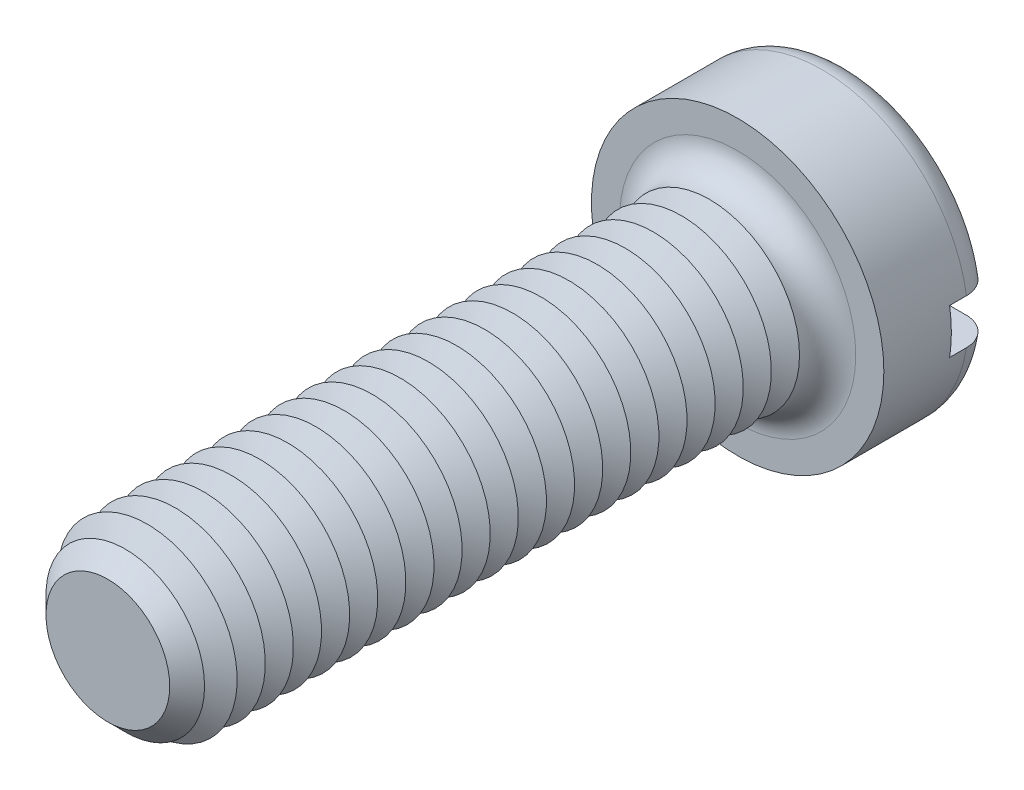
ISO-10303-21;
HEADER;
FILE_DESCRIPTION(('STEP AP214'),'2;1');
FILE_NAME('part.step','',(''),(''),'','','');
FILE_SCHEMA(('AUTOMOTIVE_DESIGN { 1 0 10303 214 1 1 1 1 }'));
ENDSEC;
DATA;
#1=APPLICATION_CONTEXT('core data for automotive mechanical design processes');
#2=APPLICATION_PROTOCOL_DEFINITION('international standard','automotive_design',2000,#1);
#3=PRODUCT_CONTEXT('',#1,'mechanical');
#4=PRODUCT('Part','Part','',(#3));
#5=PRODUCT_RELATED_PRODUCT_CATEGORY('part','',(#4));
#6=PRODUCT_DEFINITION_FORMATION('','',#4);
#7=PRODUCT_DEFINITION_CONTEXT('part definition',#1,'design');
#8=PRODUCT_DEFINITION('design','',#6,#7);
#9=PRODUCT_DEFINITION_SHAPE('','',#8);
#10=(LENGTH_UNIT() NAMED_UNIT(*) SI_UNIT(.MILLI.,.METRE.));
#11=(NAMED_UNIT(*) PLANE_ANGLE_UNIT() SI_UNIT($,.RADIAN.));
#12=(NAMED_UNIT(*) SI_UNIT($,.STERADIAN.) SOLID_ANGLE_UNIT());
#13=UNCERTAINTY_MEASURE_WITH_UNIT(LENGTH_MEASURE(1.E-05),#10,'distance_accuracy_value','');
#14=(GEOMETRIC_REPRESENTATION_CONTEXT(3) GLOBAL_UNCERTAINTY_ASSIGNED_CONTEXT((#13)) GLOBAL_UNIT_ASSIGNED_CONTEXT((#10,
#11,#12)) REPRESENTATION_CONTEXT('',''));
#15=CARTESIAN_POINT('',(0.,0.,0.));
#16=DIRECTION('',(0.,0.,1.));
#17=DIRECTION('',(1.,0.,0.));
#18=AXIS2_PLACEMENT_3D('',#15,#16,#17);
#19=CARTESIAN_POINT('',(0.,0.,-5.));
#20=DIRECTION('',(0.,0.,1.));
#21=DIRECTION('',(1.,0.,0.));
#22=AXIS2_PLACEMENT_3D('',#19,#20,#21);
#23=PLANE('',#22);
#24=CARTESIAN_POINT('',(0.,0.,-5.));
#25=DIRECTION('',(0.,0.,1.));
#26=DIRECTION('',(1.,0.,0.));
#27=AXIS2_PLACEMENT_3D('',#24,#25,#26);
#28=CIRCLE('',#27,5.25);
#29=CARTESIAN_POINT('',(-5.15388203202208,1.,-5.));
#30=VERTEX_POINT('',#29);
#31=CARTESIAN_POINT('',(5.15388203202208,1.,-5.));
#32=VERTEX_POINT('',#31);
#33=EDGE_CURVE('E116',#30,#32,#28,.F.);
#34=ORIENTED_EDGE('',*,*,#33,.T.);
#35=DIRECTION('',(1.,0.,0.));
#36=VECTOR('',#35,1.);
#37=CARTESIAN_POINT('',(-6.5,1.,-5.));
#38=LINE('',#37,#36);
#39=EDGE_CURVE('E111',#30,#32,#38,.T.);
#40=ORIENTED_EDGE('',*,*,#39,.F.);
#41=EDGE_LOOP('',(#34,#40));
#42=FACE_BOUND('',#41,.T.);
#43=ADVANCED_FACE('F39',(#42),#23,.F.);
#44=CARTESIAN_POINT('',(0.,0.,-3.75));
#45=DIRECTION('',(0.,0.,1.));
#46=DIRECTION('',(1.,0.,0.));
#47=AXIS2_PLACEMENT_3D('',#44,#45,#46);
#48=TOROIDAL_SURFACE('',#47,5.25,1.25);
#49=CARTESIAN_POINT('',(-6.04655789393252,1.,-4.63904490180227));
#50=CARTESIAN_POINT('',(-5.99546860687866,1.,-4.68885774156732));
#51=CARTESIAN_POINT('',(-5.94008472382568,1.,-4.73434760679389));
#52=CARTESIAN_POINT('',(-5.8223927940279,1.,-4.81538052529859));
#53=CARTESIAN_POINT('',(-5.7600753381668,1.,-4.85090982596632));
#54=CARTESIAN_POINT('',(-5.63044351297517,1.,-4.91100606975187));
#55=CARTESIAN_POINT('',(-5.56313479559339,1.,-4.93558519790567));
#56=CARTESIAN_POINT('',(-5.42539577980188,1.,-4.97322457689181));
#57=CARTESIAN_POINT('',(-5.35496625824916,1.,-4.98628767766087));
#58=CARTESIAN_POINT('',(-5.21212635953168,1.,-5.00070478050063));
#59=CARTESIAN_POINT('',(-5.13970265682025,1.,-5.00192674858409));
#60=CARTESIAN_POINT('',(-4.99565121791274,1.,-4.99234085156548));
#61=CARTESIAN_POINT('',(-4.92402357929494,1.,-4.98153152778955));
#62=CARTESIAN_POINT('',(-4.78274786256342,1.,-4.94801424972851));
#63=CARTESIAN_POINT('',(-4.71313137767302,1.,-4.92517296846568));
#64=CARTESIAN_POINT('',(-4.57871041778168,1.,-4.86813760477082));
#65=CARTESIAN_POINT('',(-4.51390612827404,1.,-4.83394308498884));
#66=CARTESIAN_POINT('',(-4.39095493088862,1.,-4.75508341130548));
#67=CARTESIAN_POINT('',(-4.33281197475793,1.,-4.7104120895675));
#68=CARTESIAN_POINT('',(-4.22499800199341,1.,-4.61179869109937));
#69=CARTESIAN_POINT('',(-4.17532640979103,1.,-4.55785724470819));
#70=CARTESIAN_POINT('',(-4.08677450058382,1.,-4.4431082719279));
#71=CARTESIAN_POINT('',(-4.0477350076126,1.,-4.38242369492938));
#72=CARTESIAN_POINT('',(-3.98074296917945,1.,-4.25521412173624));
#73=CARTESIAN_POINT('',(-3.95278836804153,1.,-4.18869021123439));
#74=CARTESIAN_POINT('',(-3.90959497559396,1.,-4.0537026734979));
#75=CARTESIAN_POINT('',(-3.89401985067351,1.,-3.98534663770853));
#76=CARTESIAN_POINT('',(-3.8748586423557,1.,-3.84697740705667));
#77=CARTESIAN_POINT('',(-3.87127067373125,1.,-3.7769644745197));
#78=CARTESIAN_POINT('',(-3.8761573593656,1.,-3.63892215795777));
#79=CARTESIAN_POINT('',(-3.88436651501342,1.,-3.57088319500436));
#80=CARTESIAN_POINT('',(-3.91207743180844,1.,-3.43714958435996));
#81=CARTESIAN_POINT('',(-3.93157911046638,1.,-3.37145491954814));
#82=CARTESIAN_POINT('',(-3.98125045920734,1.,-3.24411474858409));
#83=CARTESIAN_POINT('',(-4.01143761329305,1.,-3.18247607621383));
#84=CARTESIAN_POINT('',(-4.08150210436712,1.,-3.064981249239));
#85=CARTESIAN_POINT('',(-4.12138048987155,1.,-3.0091257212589));
#86=CARTESIAN_POINT('',(-4.2106718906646,1.,-2.90336353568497));
#87=CARTESIAN_POINT('',(-4.26028693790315,1.,-2.85362751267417));
#88=CARTESIAN_POINT('',(-4.36696587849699,1.,-2.76291710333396));
#89=CARTESIAN_POINT('',(-4.42403082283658,1.,-2.72194395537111));
#90=CARTESIAN_POINT('',(-4.54567957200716,1.,-2.64877280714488));
#91=CARTESIAN_POINT('',(-4.61042643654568,1.,-2.61684571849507));
#92=CARTESIAN_POINT('',(-4.74430563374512,1.,-2.56412359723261));
#93=CARTESIAN_POINT('',(-4.81343838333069,1.,-2.54332962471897));
#94=CARTESIAN_POINT('',(-4.95527237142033,1.,-2.51320471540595));
#95=CARTESIAN_POINT('',(-5.0280120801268,1.,-2.50405449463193));
#96=CARTESIAN_POINT('',(-5.17399775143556,1.,-2.49810126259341));
#97=CARTESIAN_POINT('',(-5.24724372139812,1.,-2.50129843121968));
#98=CARTESIAN_POINT('',(-5.3921014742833,1.,-2.52000776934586));
#99=CARTESIAN_POINT('',(-5.4637142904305,1.,-2.53551191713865));
#100=CARTESIAN_POINT('',(-5.60326680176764,1.,-2.57846304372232));
#101=CARTESIAN_POINT('',(-5.67120668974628,1.,-2.60590939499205));
#102=CARTESIAN_POINT('',(-5.80064060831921,1.,-2.67164926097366));
#103=CARTESIAN_POINT('',(-5.862199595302,1.,-2.7098148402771));
#104=CARTESIAN_POINT('',(-5.9779079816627,1.,-2.79608690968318));
#105=CARTESIAN_POINT('',(-6.03205795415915,1.,-2.84419263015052));
#106=CARTESIAN_POINT('',(-6.13055119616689,1.,-2.94820522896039));
#107=CARTESIAN_POINT('',(-6.17502887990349,1.,-3.00398483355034));
#108=CARTESIAN_POINT('',(-6.25384180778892,1.,-3.12230113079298));
#109=CARTESIAN_POINT('',(-6.28817779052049,1.,-3.18483733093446));
#110=CARTESIAN_POINT('',(-6.34527986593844,1.,-3.31401726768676));
#111=CARTESIAN_POINT('',(-6.36818984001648,1.,-3.38059742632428));
#112=CARTESIAN_POINT('',(-6.40240470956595,1.,-3.5166725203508));
#113=CARTESIAN_POINT('',(-6.41371067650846,1.,-3.58616718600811));
#114=CARTESIAN_POINT('',(-6.42433240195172,1.,-3.72550026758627));
#115=CARTESIAN_POINT('',(-6.4237441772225,1.,-3.79533138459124));
#116=CARTESIAN_POINT('',(-6.41082814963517,1.,-3.93391789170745));
#117=CARTESIAN_POINT('',(-6.39849757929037,1.,-4.00267302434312));
#118=CARTESIAN_POINT('',(-6.36249191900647,1.,-4.13704597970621));
#119=CARTESIAN_POINT('',(-6.33883072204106,1.,-4.20266753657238));
#120=CARTESIAN_POINT('',(-6.28088769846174,1.,-4.32897165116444));
#121=CARTESIAN_POINT('',(-6.24661890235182,1.,-4.38966015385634));
#122=CARTESIAN_POINT('',(-6.18404039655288,1.,-4.48163773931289));
#123=CARTESIAN_POINT('',(-6.15876600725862,1.,-4.51503333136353));
#124=CARTESIAN_POINT('',(-6.10500607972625,1.,-4.5791298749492));
#125=CARTESIAN_POINT('',(-6.07652056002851,1.,-4.60983084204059));
#126=CARTESIAN_POINT('',(-6.04655789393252,1.,-4.63904490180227));
#127=B_SPLINE_CURVE_WITH_KNOTS('',3,(#49,#50,#51,#52,#53,#54,#55,#56,#57,#58,#59,#60,#61,#62,
#63,#64,#65,#66,#67,#68,#69,#70,#71,#72,#73,#74,#75,#76,#77,#78,#79,#80,#81,#82,#83,#84,#85,#86,
#87,#88,#89,#90,#91,#92,#93,#94,#95,#96,#97,#98,#99,#100,#101,#102,#103,#104,#105,#106,#107,
#108,#109,#110,#111,#112,#113,#114,#115,#116,#117,#118,#119,#120,#121,#122,#123,#124,#125,#126),
.UNSPECIFIED.,.T.,.F.,(4,2,2,2,2,2,2,2,2,2,2,2,2,2,2,2,2,2,2,2,2,2,2,2,2,2,2,2,2,2,2,2,2,2,2,2,
2,2,4),(0.,0.213907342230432,0.428108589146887,0.642070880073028,0.855980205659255,
1.07227200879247,1.28859003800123,1.50735715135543,1.72613269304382,1.94503735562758,
2.16392713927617,2.37933295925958,2.59469881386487,2.80399176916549,3.01325180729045,
3.2178754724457,3.42249764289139,3.62745618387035,3.83243690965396,4.04223444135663,
4.25206160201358,4.46763253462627,4.68322399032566,4.90212226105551,5.12102372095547,
5.33978261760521,5.55853002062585,5.77477015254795,5.99099354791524,6.20398686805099,
6.41696467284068,6.62718821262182,6.83739233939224,7.0459002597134,7.25445733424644,
7.46275934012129,7.67080647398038,7.79625882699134,7.92171045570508),.UNSPECIFIED.);
#128=CARTESIAN_POINT('',(-6.42261628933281,1.,-3.74999999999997));
#129=VERTEX_POINT('',#128);
#130=EDGE_CURVE('E353',#129,#30,#127,.T.);
#131=ORIENTED_EDGE('',*,*,#130,.F.);
#132=CARTESIAN_POINT('',(0.,0.,-3.75));
#133=DIRECTION('',(0.,0.,1.));
#134=DIRECTION('',(1.,0.,0.));
#135=AXIS2_PLACEMENT_3D('',#132,#133,#134);
#136=CIRCLE('',#135,6.5);
#137=CARTESIAN_POINT('',(6.42261628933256,1.,-3.75));
#138=VERTEX_POINT('',#137);
#139=EDGE_CURVE('E125',#138,#129,#136,.T.);
#140=ORIENTED_EDGE('',*,*,#139,.F.);
#141=CARTESIAN_POINT('',(4.06944999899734,1.,-4.4133199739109));
#142=CARTESIAN_POINT('',(4.10828271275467,1.,-4.47354709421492));
#143=CARTESIAN_POINT('',(4.15233880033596,1.,-4.53047894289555));
#144=CARTESIAN_POINT('',(4.24946916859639,1.,-4.63614530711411));
#145=CARTESIAN_POINT('',(4.3025574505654,1.,-4.68486685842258));
#146=CARTESIAN_POINT('',(4.41603250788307,1.,-4.77271114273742));
#147=CARTESIAN_POINT('',(4.47640839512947,1.,-4.8118479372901));
#148=CARTESIAN_POINT('',(4.60277035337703,1.,-4.87959878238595));
#149=CARTESIAN_POINT('',(4.66875480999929,1.,-4.90821584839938));
#150=CARTESIAN_POINT('',(4.80558589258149,1.,-4.95456537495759));
#151=CARTESIAN_POINT('',(4.87649196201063,1.,-4.97212253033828));
#152=CARTESIAN_POINT('',(5.02024710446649,1.,-4.99514979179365));
#153=CARTESIAN_POINT('',(5.09309636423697,1.,-5.00061873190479));
#154=CARTESIAN_POINT('',(5.23902872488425,1.,-4.99926689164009));
#155=CARTESIAN_POINT('',(5.31211131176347,1.,-4.99238812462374));
#156=CARTESIAN_POINT('',(5.45605806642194,1.,-4.96635140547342));
#157=CARTESIAN_POINT('',(5.52692231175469,1.,-4.94719388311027));
#158=CARTESIAN_POINT('',(5.66376170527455,1.,-4.89728421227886));
#159=CARTESIAN_POINT('',(5.72977335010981,1.,-4.86663219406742));
#160=CARTESIAN_POINT('',(5.85560715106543,1.,-4.79452334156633));
#161=CARTESIAN_POINT('',(5.91542977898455,1.,-4.7530673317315));
#162=CARTESIAN_POINT('',(6.02626022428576,1.,-4.66116821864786));
#163=CARTESIAN_POINT('',(6.07738307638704,1.,-4.6108638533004));
#164=CARTESIAN_POINT('',(6.17030947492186,1.,-4.50227823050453));
#165=CARTESIAN_POINT('',(6.2121137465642,1.,-4.44399759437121));
#166=CARTESIAN_POINT('',(6.28460268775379,1.,-4.32200305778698));
#167=CARTESIAN_POINT('',(6.31543589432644,1.,-4.2583773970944));
#168=CARTESIAN_POINT('',(6.36586009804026,1.,-4.12681721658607));
#169=CARTESIAN_POINT('',(6.38545178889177,1.,-4.0588829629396));
#170=CARTESIAN_POINT('',(6.41265760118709,1.,-3.92136007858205));
#171=CARTESIAN_POINT('',(6.42038873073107,1.,-3.85179457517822));
#172=CARTESIAN_POINT('',(6.42401070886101,1.,-3.7123569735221));
#173=CARTESIAN_POINT('',(6.41990193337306,1.,-3.64248488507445));
#174=CARTESIAN_POINT('',(6.40000894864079,1.,-3.50470871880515));
#175=CARTESIAN_POINT('',(6.38427119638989,1.,-3.43679792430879));
#176=CARTESIAN_POINT('',(6.34164491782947,1.,-3.30457296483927));
#177=CARTESIAN_POINT('',(6.31475638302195,1.,-3.24025880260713));
#178=CARTESIAN_POINT('',(6.2505455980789,1.,-3.11686791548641));
#179=CARTESIAN_POINT('',(6.21319759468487,1.,-3.05780459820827));
#180=CARTESIAN_POINT('',(6.12919411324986,1.,-2.94671919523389));
#181=CARTESIAN_POINT('',(6.08253833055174,1.,-2.89469734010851));
#182=CARTESIAN_POINT('',(5.98083387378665,1.,-2.79868150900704));
#183=CARTESIAN_POINT('',(5.92571704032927,1.,-2.75475975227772));
#184=CARTESIAN_POINT('',(5.80897194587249,1.,-2.67665277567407));
#185=CARTESIAN_POINT('',(5.74734329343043,1.,-2.64246814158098));
#186=CARTESIAN_POINT('',(5.6184644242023,1.,-2.58431810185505));
#187=CARTESIAN_POINT('',(5.55115102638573,1.,-2.56049275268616));
#188=CARTESIAN_POINT('',(5.41351272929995,1.,-2.52429868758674));
#189=CARTESIAN_POINT('',(5.34318759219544,1.,-2.51193087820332));
#190=CARTESIAN_POINT('',(5.20041507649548,1.,-2.49882112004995));
#191=CARTESIAN_POINT('',(5.12795169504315,1.,-2.49825332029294));
#192=CARTESIAN_POINT('',(4.98393373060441,1.,-2.50914771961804));
#193=CARTESIAN_POINT('',(4.91237921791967,1.,-2.52061084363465));
#194=CARTESIAN_POINT('',(4.77137358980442,1.,-2.55542281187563));
#195=CARTESIAN_POINT('',(4.70195472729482,1.,-2.57890245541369));
#196=CARTESIAN_POINT('',(4.56803538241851,1.,-2.63717701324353));
#197=CARTESIAN_POINT('',(4.50353509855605,1.,-2.67197238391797));
#198=CARTESIAN_POINT('',(4.38131858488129,1.,-2.7519648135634));
#199=CARTESIAN_POINT('',(4.32360365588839,1.,-2.79716386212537));
#200=CARTESIAN_POINT('',(4.21673400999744,1.,-2.89675634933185));
#201=CARTESIAN_POINT('',(4.16757871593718,1.,-2.95114916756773));
#202=CARTESIAN_POINT('',(4.08014713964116,1.,-3.06667703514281));
#203=CARTESIAN_POINT('',(4.04170608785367,1.,-3.12768727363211));
#204=CARTESIAN_POINT('',(3.97596192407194,1.,-3.25543782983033));
#205=CARTESIAN_POINT('',(3.94865624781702,1.,-3.32217682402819));
#206=CARTESIAN_POINT('',(3.9067737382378,1.,-3.45745603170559));
#207=CARTESIAN_POINT('',(3.89185707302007,1.,-3.52589108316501));
#208=CARTESIAN_POINT('',(3.87400755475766,1.,-3.66432360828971));
#209=CARTESIAN_POINT('',(3.87107601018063,1.,-3.73432125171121));
#210=CARTESIAN_POINT('',(3.8772387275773,1.,-3.87228267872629));
#211=CARTESIAN_POINT('',(3.88607933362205,1.,-3.94025811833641));
#212=CARTESIAN_POINT('',(3.91502769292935,1.,-4.07370133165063));
#213=CARTESIAN_POINT('',(3.93512131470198,1.,-4.1391721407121));
#214=CARTESIAN_POINT('',(3.9752037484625,1.,-4.23926719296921));
#215=CARTESIAN_POINT('',(3.99171171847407,1.,-4.27532618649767));
#216=CARTESIAN_POINT('',(4.02809737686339,1.,-4.34569933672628));
#217=CARTESIAN_POINT('',(4.04797497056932,1.,-4.3800135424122));
#218=CARTESIAN_POINT('',(4.06944999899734,1.,-4.4133199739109));
#219=B_SPLINE_CURVE_WITH_KNOTS('',3,(#141,#142,#143,#144,#145,#146,#147,#148,#149,#150,#151,
#152,#153,#154,#155,#156,#157,#158,#159,#160,#161,#162,#163,#164,#165,#166,#167,#168,#169,#170,
#171,#172,#173,#174,#175,#176,#177,#178,#179,#180,#181,#182,#183,#184,#185,#186,#187,#188,#189,
#190,#191,#192,#193,#194,#195,#196,#197,#198,#199,#200,#201,#202,#203,#204,#205,#206,#207,#208,
#209,#210,#211,#212,#213,#214,#215,#216,#217,#218),.UNSPECIFIED.,.T.,.F.,(4,2,2,2,2,2,2,2,2,2,2,
2,2,2,2,2,2,2,2,2,2,2,2,2,2,2,2,2,2,2,2,2,2,2,2,2,2,2,4),(0.,0.214833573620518,
0.430003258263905,0.644855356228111,0.859645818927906,1.0777603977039,1.29589601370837,
1.51505870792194,1.73421373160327,1.95150241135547,2.16877451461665,2.38290237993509,
2.59701357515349,2.8081044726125,3.01918234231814,3.22816416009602,3.43713934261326,
3.64528416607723,3.85342914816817,4.06209119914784,4.27076008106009,4.48120788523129,
4.69166834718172,4.90489186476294,5.11813225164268,5.33451752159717,5.55091942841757,
5.76972860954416,5.98854661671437,6.20740650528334,6.42625163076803,6.64151774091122,
6.85673425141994,7.0658317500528,7.27495207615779,7.47963858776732,7.68406862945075,
7.80287790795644,7.92168384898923),.UNSPECIFIED.);
#220=EDGE_CURVE('E355',#32,#138,#219,.T.);
#221=ORIENTED_EDGE('',*,*,#220,.F.);
#222=ORIENTED_EDGE('',*,*,#33,.F.);
#223=EDGE_LOOP('',(#131,#140,#221,#222));
#224=FACE_BOUND('',#223,.T.);
#225=ADVANCED_FACE('F337',(#224),#48,.T.);
#226=CARTESIAN_POINT('',(0.,0.,-5.));
#227=DIRECTION('',(0.,0.,1.));
#228=DIRECTION('',(1.,0.,0.));
#229=AXIS2_PLACEMENT_3D('',#226,#227,#228);
#230=CYLINDRICAL_SURFACE('',#229,6.5);
#231=DIRECTION('',(0.,0.,1.));
#232=VECTOR('',#231,1.);
#233=CARTESIAN_POINT('',(6.42261628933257,1.,-5.));
#234=LINE('',#233,#232);
#235=CARTESIAN_POINT('',(6.42261628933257,1.,-3.));
#236=VERTEX_POINT('',#235);
#237=EDGE_CURVE('E369',#138,#236,#234,.T.);
#238=ORIENTED_EDGE('',*,*,#237,.F.);
#239=ORIENTED_EDGE('',*,*,#139,.T.);
#240=DIRECTION('',(0.,0.,1.));
#241=VECTOR('',#240,1.);
#242=CARTESIAN_POINT('',(-6.42261628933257,1.,-5.));
#243=LINE('',#242,#241);
#244=CARTESIAN_POINT('',(-6.42261628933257,1.,-3.));
#245=VERTEX_POINT('',#244);
#246=EDGE_CURVE('E63',#245,#129,#243,.F.);
#247=ORIENTED_EDGE('',*,*,#246,.F.);
#248=CARTESIAN_POINT('',(0.,0.,-3.));
#249=DIRECTION('',(0.,0.,-1.));
#250=DIRECTION('',(-1.,0.,0.));
#251=AXIS2_PLACEMENT_3D('',#248,#249,#250);
#252=CIRCLE('',#251,6.5);
#253=CARTESIAN_POINT('',(-6.42261628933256,-0.999999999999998,-3.));
#254=VERTEX_POINT('',#253);
#255=EDGE_CURVE('E43',#245,#254,#252,.F.);
#256=ORIENTED_EDGE('',*,*,#255,.T.);
#257=DIRECTION('',(0.,0.,1.));
#258=VECTOR('',#257,1.);
#259=CARTESIAN_POINT('',(-6.42261628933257,-0.999999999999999,-5.));
#260=LINE('',#259,#258);
#261=CARTESIAN_POINT('',(-6.42261628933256,-0.999999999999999,-3.75));
#262=VERTEX_POINT('',#261);
#263=EDGE_CURVE('E366',#262,#254,#260,.T.);
#264=ORIENTED_EDGE('',*,*,#263,.F.);
#265=CARTESIAN_POINT('',(6.42261628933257,-1.,-3.75));
#266=VERTEX_POINT('',#265);
#267=EDGE_CURVE('E127',#262,#266,#136,.T.);
#268=ORIENTED_EDGE('',*,*,#267,.T.);
#269=DIRECTION('',(0.,0.,1.));
#270=VECTOR('',#269,1.);
#271=CARTESIAN_POINT('',(6.42261628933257,-1.,-5.));
#272=LINE('',#271,#270);
#273=CARTESIAN_POINT('',(6.42261628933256,-1.,-3.));
#274=VERTEX_POINT('',#273);
#275=EDGE_CURVE('E55',#274,#266,#272,.F.);
#276=ORIENTED_EDGE('',*,*,#275,.F.);
#277=EDGE_CURVE('E11',#274,#236,#252,.F.);
#278=ORIENTED_EDGE('',*,*,#277,.T.);
#279=EDGE_LOOP('',(#238,#239,#247,#256,#264,#268,#276,#278));
#280=FACE_BOUND('',#279,.T.);
#281=CARTESIAN_POINT('',(0.,0.,0.));
#282=DIRECTION('',(0.,0.,1.));
#283=DIRECTION('',(1.,0.,0.));
#284=AXIS2_PLACEMENT_3D('',#281,#282,#283);
#285=CIRCLE('',#284,6.5);
#286=CARTESIAN_POINT('',(6.5,0.,0.));
#287=VERTEX_POINT('',#286);
#288=EDGE_CURVE('E372',#287,#287,#285,.T.);
#289=ORIENTED_EDGE('',*,*,#288,.F.);
#290=EDGE_LOOP('',(#289));
#291=FACE_BOUND('',#290,.T.);
#292=ADVANCED_FACE('F333',(#280,#291),#230,.T.);
#293=CARTESIAN_POINT('',(5.15388203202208,-1.,-5.));
#294=VERTEX_POINT('',#293);
#295=CARTESIAN_POINT('',(-5.15388203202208,-0.999999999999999,-5.));
#296=VERTEX_POINT('',#295);
#297=EDGE_CURVE('E109',#294,#296,#28,.F.);
#298=ORIENTED_EDGE('',*,*,#297,.T.);
#299=DIRECTION('',(-1.,0.,0.));
#300=VECTOR('',#299,1.);
#301=CARTESIAN_POINT('',(-6.5,-0.999999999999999,-5.));
#302=LINE('',#301,#300);
#303=EDGE_CURVE('E96',#294,#296,#302,.T.);
#304=ORIENTED_EDGE('',*,*,#303,.F.);
#305=EDGE_LOOP('',(#298,#304));
#306=FACE_BOUND('',#305,.T.);
#307=ADVANCED_FACE('F108',(#306),#23,.F.);
#308=CARTESIAN_POINT('',(0.,0.,0.));
#309=DIRECTION('',(0.,0.,1.));
#310=DIRECTION('',(1.,0.,0.));
#311=AXIS2_PLACEMENT_3D('',#308,#309,#310);
#312=PLANE('',#311);
#313=CARTESIAN_POINT('',(0.,0.,0.));
#314=DIRECTION('',(0.,0.,1.));
#315=DIRECTION('',(1.,0.,0.));
#316=AXIS2_PLACEMENT_3D('',#313,#314,#315);
#317=CIRCLE('',#316,5.25);
#318=CARTESIAN_POINT('',(5.25,0.,0.));
#319=VERTEX_POINT('',#318);
#320=EDGE_CURVE('E115',#319,#319,#317,.F.);
#321=ORIENTED_EDGE('',*,*,#320,.T.);
#322=EDGE_LOOP('',(#321));
#323=FACE_BOUND('',#322,.T.);
#324=ORIENTED_EDGE('',*,*,#288,.T.);
#325=EDGE_LOOP('',(#324));
#326=FACE_BOUND('',#325,.T.);
#327=ADVANCED_FACE('F332',(#323,#326),#312,.T.);
#328=CARTESIAN_POINT('',(-6.04655789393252,-0.999999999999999,-4.63904490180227));
#329=CARTESIAN_POINT('',(-6.0966604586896,-0.999999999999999,-4.59018532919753));
#330=CARTESIAN_POINT('',(-6.14270501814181,-0.999999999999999,-4.53709744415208));
#331=CARTESIAN_POINT('',(-6.22528519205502,-0.999999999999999,-4.42391631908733));
#332=CARTESIAN_POINT('',(-6.26181074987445,-0.999999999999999,-4.36381576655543));
#333=CARTESIAN_POINT('',(-6.32422109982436,-0.999999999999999,-4.23831836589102));
#334=CARTESIAN_POINT('',(-6.35010658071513,-0.999999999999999,-4.17292186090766));
#335=CARTESIAN_POINT('',(-6.39044668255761,-0.999999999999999,-4.03870925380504));
#336=CARTESIAN_POINT('',(-6.40490396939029,-0.999999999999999,-3.96989395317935));
#337=CARTESIAN_POINT('',(-6.42190814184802,-0.999999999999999,-3.83122595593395));
#338=CARTESIAN_POINT('',(-6.4245257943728,-0.999999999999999,-3.76138193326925));
#339=CARTESIAN_POINT('',(-6.41796432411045,-0.999999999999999,-3.62224935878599));
#340=CARTESIAN_POINT('',(-6.40878509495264,-0.999999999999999,-3.55296081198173));
#341=CARTESIAN_POINT('',(-6.37894560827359,-0.999999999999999,-3.41709241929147));
#342=CARTESIAN_POINT('',(-6.35831520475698,-0.999999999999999,-3.35050601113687));
#343=CARTESIAN_POINT('',(-6.30620980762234,-0.999999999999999,-3.22172312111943));
#344=CARTESIAN_POINT('',(-6.2747347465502,-0.999999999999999,-3.15952666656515));
#345=CARTESIAN_POINT('',(-6.20172710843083,-0.999999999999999,-3.04101762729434));
#346=CARTESIAN_POINT('',(-6.16015622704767,-0.999999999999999,-2.98472864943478));
#347=CARTESIAN_POINT('',(-6.06823774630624,-0.999999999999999,-2.87984578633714));
#348=CARTESIAN_POINT('',(-6.01788981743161,-0.999999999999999,-2.83125219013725));
#349=CARTESIAN_POINT('',(-5.90933830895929,-0.999999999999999,-2.74262118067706));
#350=CARTESIAN_POINT('',(-5.85106338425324,-0.999999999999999,-2.70267117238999));
#351=CARTESIAN_POINT('',(-5.72870702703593,-0.999999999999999,-2.63296796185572));
#352=CARTESIAN_POINT('',(-5.66462521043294,-0.999999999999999,-2.6032154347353));
#353=CARTESIAN_POINT('',(-5.53153273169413,-0.999999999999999,-2.55430842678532));
#354=CARTESIAN_POINT('',(-5.46246626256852,-0.999999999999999,-2.53530583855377));
#355=CARTESIAN_POINT('',(-5.32214267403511,-0.999999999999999,-2.5089831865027));
#356=CARTESIAN_POINT('',(-5.25088537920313,-0.999999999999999,-2.50166406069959));
#357=CARTESIAN_POINT('',(-5.10710123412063,-0.999999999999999,-2.49882202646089));
#358=CARTESIAN_POINT('',(-5.03457095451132,-0.999999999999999,-2.50347166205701));
#359=CARTESIAN_POINT('',(-4.8912897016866,-0.999999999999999,-2.52476029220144));
#360=CARTESIAN_POINT('',(-4.82053886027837,-0.999999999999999,-2.54140017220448));
#361=CARTESIAN_POINT('',(-4.68213257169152,-0.999999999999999,-2.58641614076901));
#362=CARTESIAN_POINT('',(-4.61451256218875,-0.999999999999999,-2.61490131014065));
#363=CARTESIAN_POINT('',(-4.48502801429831,-0.999999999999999,-2.68285095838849));
#364=CARTESIAN_POINT('',(-4.42316359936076,-0.999999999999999,-2.72231567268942));
#365=CARTESIAN_POINT('',(-4.30720694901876,-0.999999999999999,-2.81103994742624));
#366=CARTESIAN_POINT('',(-4.25309118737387,-0.999999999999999,-2.86026872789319));
#367=CARTESIAN_POINT('',(-4.15409408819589,-0.999999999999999,-2.9672764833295));
#368=CARTESIAN_POINT('',(-4.10921182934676,-0.999999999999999,-3.02505460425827));
#369=CARTESIAN_POINT('',(-4.03096584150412,-0.999999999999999,-3.14632492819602));
#370=CARTESIAN_POINT('',(-3.99739097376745,-0.999999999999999,-3.2096807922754));
#371=CARTESIAN_POINT('',(-3.94171839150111,-0.999999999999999,-3.34124912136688));
#372=CARTESIAN_POINT('',(-3.91961840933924,-0.999999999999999,-3.40946062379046));
#373=CARTESIAN_POINT('',(-3.88816636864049,-0.999999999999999,-3.54669256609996));
#374=CARTESIAN_POINT('',(-3.87846562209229,-0.999999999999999,-3.61563318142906));
#375=CARTESIAN_POINT('',(-3.87100568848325,-0.999999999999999,-3.75415397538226));
#376=CARTESIAN_POINT('',(-3.87324501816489,-0.999999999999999,-3.82373407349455));
#377=CARTESIAN_POINT('',(-3.88943589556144,-0.999999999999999,-3.96027701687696));
#378=CARTESIAN_POINT('',(-3.90318225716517,-0.999999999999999,-4.0272643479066));
#379=CARTESIAN_POINT('',(-3.94163954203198,-0.999999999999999,-4.1580093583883));
#380=CARTESIAN_POINT('',(-3.96635075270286,-0.999999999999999,-4.22176695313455));
#381=CARTESIAN_POINT('',(-4.026160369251,-0.999999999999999,-4.34483320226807));
#382=CARTESIAN_POINT('',(-4.06134035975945,-0.999999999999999,-4.40410214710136));
#383=CARTESIAN_POINT('',(-4.14090865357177,-0.999999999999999,-4.51609417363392));
#384=CARTESIAN_POINT('',(-4.18529811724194,-0.999999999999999,-4.56881642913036));
#385=CARTESIAN_POINT('',(-4.2832649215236,-0.999999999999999,-4.66770177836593));
#386=CARTESIAN_POINT('',(-4.33705327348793,-0.999999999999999,-4.71365579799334));
#387=CARTESIAN_POINT('',(-4.45141776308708,-0.999999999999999,-4.79615385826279));
#388=CARTESIAN_POINT('',(-4.51199483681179,-0.999999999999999,-4.83269659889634));
#389=CARTESIAN_POINT('',(-4.63989216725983,-0.999999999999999,-4.89626962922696));
#390=CARTESIAN_POINT('',(-4.70734508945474,-0.999999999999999,-4.92303326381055));
#391=CARTESIAN_POINT('',(-4.84575497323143,-0.999999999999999,-4.96500199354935));
#392=CARTESIAN_POINT('',(-4.91671207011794,-0.999999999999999,-4.98020664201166));
#393=CARTESIAN_POINT('',(-5.06097761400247,-0.999999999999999,-4.9987306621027));
#394=CARTESIAN_POINT('',(-5.13430353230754,-0.999999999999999,-5.00191441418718));
#395=CARTESIAN_POINT('',(-5.28046546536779,-0.999999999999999,-4.99587686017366));
#396=CARTESIAN_POINT('',(-5.35330135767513,-0.999999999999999,-4.98665256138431));
#397=CARTESIAN_POINT('',(-5.49610354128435,-0.999999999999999,-4.95604184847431));
#398=CARTESIAN_POINT('',(-5.56607890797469,-0.999999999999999,-4.93469772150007));
#399=CARTESIAN_POINT('',(-5.70131538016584,-0.999999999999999,-4.88041956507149));
#400=CARTESIAN_POINT('',(-5.76658233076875,-0.999999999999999,-4.84750021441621));
#401=CARTESIAN_POINT('',(-5.86782577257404,-0.999999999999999,-4.78498748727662));
#402=CARTESIAN_POINT('',(-5.90579749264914,-0.999999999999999,-4.75856648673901));
#403=CARTESIAN_POINT('',(-5.97862186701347,-0.999999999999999,-4.70172646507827));
#404=CARTESIAN_POINT('',(-6.0134745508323,-0.999999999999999,-4.6713074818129));
#405=CARTESIAN_POINT('',(-6.04655789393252,-0.999999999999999,-4.63904490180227));
#406=B_SPLINE_CURVE_WITH_KNOTS('',3,(#328,#329,#330,#331,#332,#333,#334,#335,#336,#337,#338,
#339,#340,#341,#342,#343,#344,#345,#346,#347,#348,#349,#350,#351,#352,#353,#354,#355,#356,#357,
#358,#359,#360,#361,#362,#363,#364,#365,#366,#367,#368,#369,#370,#371,#372,#373,#374,#375,#376,
#377,#378,#379,#380,#381,#382,#383,#384,#385,#386,#387,#388,#389,#390,#391,#392,#393,#394,#395,
#396,#397,#398,#399,#400,#401,#402,#403,#404,#405),.UNSPECIFIED.,.T.,.F.,(4,2,2,2,2,2,2,2,2,2,2,
2,2,2,2,2,2,2,2,2,2,2,2,2,2,2,2,2,2,2,2,2,2,2,2,2,2,2,4),(0.,0.209780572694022,
0.419781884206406,0.629769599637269,0.839708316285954,1.04839053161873,1.2570746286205,
1.46521720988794,1.67336108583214,1.88230736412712,2.09126148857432,2.30223890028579,
2.51323027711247,2.72713284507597,2.94105258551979,3.15807345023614,3.37511034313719,
3.59419176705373,3.81327788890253,4.03168404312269,4.25006839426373,4.46411376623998,
4.67811682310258,4.88595885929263,5.09377507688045,5.29796268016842,5.50215563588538,
5.70798353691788,5.91383738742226,6.12510741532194,6.33640661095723,6.55309998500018,
6.76980173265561,6.98894112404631,7.20813337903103,7.42656551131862,7.64472163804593,
7.78324365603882,7.92176436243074),.UNSPECIFIED.);
#407=EDGE_CURVE('E103',#296,#262,#406,.T.);
#408=ORIENTED_EDGE('',*,*,#407,.F.);
#409=ORIENTED_EDGE('',*,*,#297,.F.);
#410=CARTESIAN_POINT('',(4.06944999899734,-1.,-4.4133199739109));
#411=CARTESIAN_POINT('',(4.03213207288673,-1.,-4.3554312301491));
#412=CARTESIAN_POINT('',(3.9995849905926,-1.,-4.29441722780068));
#413=CARTESIAN_POINT('',(3.94511822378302,-1.,-4.16776604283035));
#414=CARTESIAN_POINT('',(3.92320762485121,-1.,-4.10212496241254));
#415=CARTESIAN_POINT('',(3.89078811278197,-1.,-3.96804412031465));
#416=CARTESIAN_POINT('',(3.88028409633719,-1.,-3.89960316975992));
#417=CARTESIAN_POINT('',(3.87107895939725,-1.,-3.76194650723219));
#418=CARTESIAN_POINT('',(3.87237511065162,-1.,-3.69273097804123));
#419=CARTESIAN_POINT('',(3.88662927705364,-1.,-3.55634460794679));
#420=CARTESIAN_POINT('',(3.89944923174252,-1.,-3.48915926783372));
#421=CARTESIAN_POINT('',(3.93611188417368,-1.,-3.35786953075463));
#422=CARTESIAN_POINT('',(3.95995518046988,-1.,-3.29376530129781));
#423=CARTESIAN_POINT('',(4.0180748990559,-1.,-3.16993562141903));
#424=CARTESIAN_POINT('',(4.05242297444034,-1.,-3.11024385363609));
#425=CARTESIAN_POINT('',(4.13041121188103,-1.,-2.9972793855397));
#426=CARTESIAN_POINT('',(4.17405248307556,-1.,-2.94400745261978));
#427=CARTESIAN_POINT('',(4.27058636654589,-1.,-2.8439150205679));
#428=CARTESIAN_POINT('',(4.32368948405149,-1.,-2.79729757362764));
#429=CARTESIAN_POINT('',(4.43679856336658,-1.,-2.71336600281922));
#430=CARTESIAN_POINT('',(4.49680546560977,-1.,-2.67605314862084));
#431=CARTESIAN_POINT('',(4.62370121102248,-1.,-2.61081752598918));
#432=CARTESIAN_POINT('',(4.69072799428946,-1.,-2.58316284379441));
#433=CARTESIAN_POINT('',(4.82843981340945,-1.,-2.5393441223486));
#434=CARTESIAN_POINT('',(4.899125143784,-1.,-2.52318100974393));
#435=CARTESIAN_POINT('',(5.04306377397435,-1.,-2.50267755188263));
#436=CARTESIAN_POINT('',(5.11633773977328,-1.,-2.49848181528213));
#437=CARTESIAN_POINT('',(5.26254809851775,-1.,-2.50249357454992));
#438=CARTESIAN_POINT('',(5.33548449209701,-1.,-2.51070104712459));
#439=CARTESIAN_POINT('',(5.4786703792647,-1.,-2.53930888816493));
#440=CARTESIAN_POINT('',(5.54892819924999,-1.,-2.5596675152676));
#441=CARTESIAN_POINT('',(5.68495799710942,-1.,-2.61204238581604));
#442=CARTESIAN_POINT('',(5.75073024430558,-1.,-2.64405792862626));
#443=CARTESIAN_POINT('',(5.8750178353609,-1.,-2.7184150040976));
#444=CARTESIAN_POINT('',(5.93361487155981,-1.,-2.76061995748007));
#445=CARTESIAN_POINT('',(6.04275377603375,-1.,-2.85440601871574));
#446=CARTESIAN_POINT('',(6.09329629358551,-1.,-2.90598637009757));
#447=CARTESIAN_POINT('',(6.18409572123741,-1.,-3.01622977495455));
#448=CARTESIAN_POINT('',(6.2244945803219,-1.,-3.07477592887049));
#449=CARTESIAN_POINT('',(6.29474798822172,-1.,-3.19788594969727));
#450=CARTESIAN_POINT('',(6.3246032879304,-1.,-3.26244938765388));
#451=CARTESIAN_POINT('',(6.37256001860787,-1.,-3.39491634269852));
#452=CARTESIAN_POINT('',(6.39079949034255,-1.,-3.46276990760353));
#453=CARTESIAN_POINT('',(6.41554133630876,-1.,-3.60058363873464));
#454=CARTESIAN_POINT('',(6.42204424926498,-1.,-3.67054370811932));
#455=CARTESIAN_POINT('',(6.42311237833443,-1.,-3.81007982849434));
#456=CARTESIAN_POINT('',(6.41775799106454,-1.,-3.879655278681));
#457=CARTESIAN_POINT('',(6.39543799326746,-1.,-4.01691664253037));
#458=CARTESIAN_POINT('',(6.3784725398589,-1.,-4.08460258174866));
#459=CARTESIAN_POINT('',(6.33344768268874,-1.,-4.21614537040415));
#460=CARTESIAN_POINT('',(6.30539273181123,-1.,-4.28000374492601));
#461=CARTESIAN_POINT('',(6.23902076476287,-1.,-4.40214140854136));
#462=CARTESIAN_POINT('',(6.20070356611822,-1.,-4.46042059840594));
#463=CARTESIAN_POINT('',(6.11467174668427,-1.,-4.5701315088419));
#464=CARTESIAN_POINT('',(6.06690270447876,-1.,-4.62152053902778));
#465=CARTESIAN_POINT('',(5.96350111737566,-1.,-4.715657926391));
#466=CARTESIAN_POINT('',(5.90786817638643,-1.,-4.75840584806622));
#467=CARTESIAN_POINT('',(5.78965380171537,-1.,-4.8345781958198));
#468=CARTESIAN_POINT('',(5.72700078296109,-1.,-4.86789149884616));
#469=CARTESIAN_POINT('',(5.59704977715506,-1.,-4.92369754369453));
#470=CARTESIAN_POINT('',(5.52975144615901,-1.,-4.94618948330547));
#471=CARTESIAN_POINT('',(5.39137621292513,-1.,-4.98006173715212));
#472=CARTESIAN_POINT('',(5.32025859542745,-1.,-4.99127571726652));
#473=CARTESIAN_POINT('',(5.17715081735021,-1.,-5.00177798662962));
#474=CARTESIAN_POINT('',(5.10516061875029,-1.,-5.00106575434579));
#475=CARTESIAN_POINT('',(4.96131924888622,-1.,-4.98769775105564));
#476=CARTESIAN_POINT('',(4.88948297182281,-1.,-4.97488146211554));
#477=CARTESIAN_POINT('',(4.74893184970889,-1.,-4.93744335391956));
#478=CARTESIAN_POINT('',(4.68021795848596,-1.,-4.91281795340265));
#479=CARTESIAN_POINT('',(4.54744428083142,-1.,-4.8522329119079));
#480=CARTESIAN_POINT('',(4.48341761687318,-1.,-4.81620070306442));
#481=CARTESIAN_POINT('',(4.36244497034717,-1.,-4.73383277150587));
#482=CARTESIAN_POINT('',(4.30549069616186,-1.,-4.68750929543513));
#483=CARTESIAN_POINT('',(4.21823158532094,-1.,-4.60311228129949));
#484=CARTESIAN_POINT('',(4.18544074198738,-1.,-4.56757118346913));
#485=CARTESIAN_POINT('',(4.12413461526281,-1.,-4.49297229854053));
#486=CARTESIAN_POINT('',(4.09561926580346,-1.,-4.45391456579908));
#487=CARTESIAN_POINT('',(4.06944999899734,-1.,-4.4133199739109));
#488=B_SPLINE_CURVE_WITH_KNOTS('',3,(#410,#411,#412,#413,#414,#415,#416,#417,#418,#419,#420,
#421,#422,#423,#424,#425,#426,#427,#428,#429,#430,#431,#432,#433,#434,#435,#436,#437,#438,#439,
#440,#441,#442,#443,#444,#445,#446,#447,#448,#449,#450,#451,#452,#453,#454,#455,#456,#457,#458,
#459,#460,#461,#462,#463,#464,#465,#466,#467,#468,#469,#470,#471,#472,#473,#474,#475,#476,#477,
#478,#479,#480,#481,#482,#483,#484,#485,#486,#487),.UNSPECIFIED.,.T.,.F.,(4,2,2,2,2,2,2,2,2,2,2,
2,2,2,2,2,2,2,2,2,2,2,2,2,2,2,2,2,2,2,2,2,2,2,2,2,2,2,4),(0.,0.206453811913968,0.4130836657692,
0.619802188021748,0.826472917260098,1.03070015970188,1.23493849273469,1.44060223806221,
1.64629054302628,1.85731119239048,2.06836062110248,2.28487349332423,2.5014038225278,
2.72053974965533,2.9396752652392,3.15806230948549,3.37643622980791,3.59203140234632,
3.80760918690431,4.01997696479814,4.23232961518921,4.44210913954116,4.65187903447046,
4.86023097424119,5.06858009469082,5.27684563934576,5.48511488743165,5.69462015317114,
5.90413597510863,6.11602561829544,6.32793096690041,6.54291770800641,6.75791385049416,
6.97580180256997,7.19375587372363,7.41312537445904,7.63223520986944,7.77701357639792,
7.92178970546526),.UNSPECIFIED.);
#489=EDGE_CURVE('E92',#266,#294,#488,.T.);
#490=ORIENTED_EDGE('',*,*,#489,.F.);
#491=ORIENTED_EDGE('',*,*,#267,.F.);
#492=EDGE_LOOP('',(#408,#409,#490,#491));
#493=FACE_BOUND('',#492,.T.);
#494=ADVANCED_FACE('F113',(#493),#48,.T.);
#495=CARTESIAN_POINT('',(0.,0.,1.25));
#496=DIRECTION('',(0.,0.,1.));
#497=DIRECTION('',(1.,0.,0.));
#498=AXIS2_PLACEMENT_3D('',#495,#496,#497);
#499=TOROIDAL_SURFACE('',#498,5.25,1.25);
#500=ORIENTED_EDGE('',*,*,#320,.F.);
#501=EDGE_LOOP('',(#500));
#502=FACE_BOUND('',#501,.T.);
#503=CARTESIAN_POINT('',(0.,0.,1.25));
#504=DIRECTION('',(0.,0.,-1.));
#505=DIRECTION('',(-1.,0.,0.));
#506=AXIS2_PLACEMENT_3D('',#503,#504,#505);
#507=CIRCLE('',#506,4.);
#508=CARTESIAN_POINT('',(-4.,0.,1.25));
#509=VERTEX_POINT('',#508);
#510=EDGE_CURVE('E377',#509,#509,#507,.T.);
#511=ORIENTED_EDGE('',*,*,#510,.T.);
#512=EDGE_LOOP('',(#511));
#513=FACE_BOUND('',#512,.T.);
#514=ADVANCED_FACE('F325',(#502,#513),#499,.F.);
#515=CARTESIAN_POINT('',(0.,0.,1.875));
#516=DIRECTION('',(0.,0.,-1.));
#517=DIRECTION('',(-1.,0.,0.));
#518=AXIS2_PLACEMENT_3D('',#515,#516,#517);
#519=CONICAL_SURFACE('',#518,2.91746824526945,1.0471975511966);
#520=ORIENTED_EDGE('',*,*,#510,.F.);
#521=EDGE_LOOP('',(#520));
#522=FACE_BOUND('',#521,.T.);
#523=CARTESIAN_POINT('',(0.,0.,1.875));
#524=DIRECTION('',(0.,0.,-1.));
#525=DIRECTION('',(-1.,0.,0.));
#526=AXIS2_PLACEMENT_3D('',#523,#524,#525);
#527=CIRCLE('',#526,2.91746824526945);
#528=CARTESIAN_POINT('',(-2.91746824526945,0.,1.875));
#529=VERTEX_POINT('',#528);
#530=EDGE_CURVE('E383',#529,#529,#527,.T.);
#531=ORIENTED_EDGE('',*,*,#530,.T.);
#532=EDGE_LOOP('',(#531));
#533=FACE_BOUND('',#532,.T.);
#534=ADVANCED_FACE('F321',(#522,#533),#519,.T.);
#535=CARTESIAN_POINT('',(0.,0.,2.5));
#536=DIRECTION('',(0.,0.,1.));
#537=DIRECTION('',(1.,0.,0.));
#538=AXIS2_PLACEMENT_3D('',#535,#536,#537);
#539=CONICAL_SURFACE('',#538,4.,1.0471975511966);
#540=ORIENTED_EDGE('',*,*,#530,.F.);
#541=EDGE_LOOP('',(#540));
#542=FACE_BOUND('',#541,.T.);
#543=CARTESIAN_POINT('',(0.,0.,2.5));
#544=DIRECTION('',(0.,0.,-1.));
#545=DIRECTION('',(-1.,0.,0.));
#546=AXIS2_PLACEMENT_3D('',#543,#544,#545);
#547=CIRCLE('',#546,4.);
#548=CARTESIAN_POINT('',(-4.,0.,2.5));
#549=VERTEX_POINT('',#548);
#550=EDGE_CURVE('E389',#549,#549,#547,.T.);
#551=ORIENTED_EDGE('',*,*,#550,.T.);
#552=EDGE_LOOP('',(#551));
#553=FACE_BOUND('',#552,.T.);
#554=ADVANCED_FACE('F317',(#542,#553),#539,.T.);
#555=CARTESIAN_POINT('',(0.,0.,3.125));
#556=DIRECTION('',(0.,0.,-1.));
#557=DIRECTION('',(-1.,0.,0.));
#558=AXIS2_PLACEMENT_3D('',#555,#556,#557);
#559=CONICAL_SURFACE('',#558,2.91746824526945,1.0471975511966);
#560=ORIENTED_EDGE('',*,*,#550,.F.);
#561=EDGE_LOOP('',(#560));
#562=FACE_BOUND('',#561,.T.);
#563=CARTESIAN_POINT('',(0.,0.,3.125));
#564=DIRECTION('',(0.,0.,-1.));
#565=DIRECTION('',(-1.,0.,0.));
#566=AXIS2_PLACEMENT_3D('',#563,#564,#565);
#567=CIRCLE('',#566,2.91746824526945);
#568=CARTESIAN_POINT('',(-2.91746824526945,0.,3.125));
#569=VERTEX_POINT('',#568);
#570=EDGE_CURVE('E393',#569,#569,#567,.T.);
#571=ORIENTED_EDGE('',*,*,#570,.T.);
#572=EDGE_LOOP('',(#571));
#573=FACE_BOUND('',#572,.T.);
#574=ADVANCED_FACE('F313',(#562,#573),#559,.T.);
#575=CARTESIAN_POINT('',(0.,0.,3.75));
#576=DIRECTION('',(0.,0.,1.));
#577=DIRECTION('',(1.,0.,0.));
#578=AXIS2_PLACEMENT_3D('',#575,#576,#577);
#579=CONICAL_SURFACE('',#578,4.,1.0471975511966);
#580=ORIENTED_EDGE('',*,*,#570,.F.);
#581=EDGE_LOOP('',(#580));
#582=FACE_BOUND('',#581,.T.);
#583=CARTESIAN_POINT('',(0.,0.,3.75));
#584=DIRECTION('',(0.,0.,-1.));
#585=DIRECTION('',(-1.,0.,0.));
#586=AXIS2_PLACEMENT_3D('',#583,#584,#585);
#587=CIRCLE('',#586,4.);
#588=CARTESIAN_POINT('',(-4.,0.,3.75));
#589=VERTEX_POINT('',#588);
#590=EDGE_CURVE('E397',#589,#589,#587,.T.);
#591=ORIENTED_EDGE('',*,*,#590,.T.);
#592=EDGE_LOOP('',(#591));
#593=FACE_BOUND('',#592,.T.);
#594=ADVANCED_FACE('F309',(#582,#593),#579,.T.);
#595=CARTESIAN_POINT('',(0.,0.,4.375));
#596=DIRECTION('',(0.,0.,-1.));
#597=DIRECTION('',(-1.,0.,0.));
#598=AXIS2_PLACEMENT_3D('',#595,#596,#597);
#599=CONICAL_SURFACE('',#598,2.91746824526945,1.0471975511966);
#600=ORIENTED_EDGE('',*,*,#590,.F.);
#601=EDGE_LOOP('',(#600));
#602=FACE_BOUND('',#601,.T.);
#603=CARTESIAN_POINT('',(0.,0.,4.375));
#604=DIRECTION('',(0.,0.,-1.));
#605=DIRECTION('',(-1.,0.,0.));
#606=AXIS2_PLACEMENT_3D('',#603,#604,#605);
#607=CIRCLE('',#606,2.91746824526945);
#608=CARTESIAN_POINT('',(-2.91746824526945,0.,4.375));
#609=VERTEX_POINT('',#608);
#610=EDGE_CURVE('E400',#609,#609,#607,.T.);
#611=ORIENTED_EDGE('',*,*,#610,.T.);
#612=EDGE_LOOP('',(#611));
#613=FACE_BOUND('',#612,.T.);
#614=ADVANCED_FACE('F305',(#602,#613),#599,.T.);
#615=CARTESIAN_POINT('',(0.,0.,5.));
#616=DIRECTION('',(0.,0.,1.));
#617=DIRECTION('',(1.,0.,0.));
#618=AXIS2_PLACEMENT_3D('',#615,#616,#617);
#619=CONICAL_SURFACE('',#618,4.,1.0471975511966);
#620=ORIENTED_EDGE('',*,*,#610,.F.);
#621=EDGE_LOOP('',(#620));
#622=FACE_BOUND('',#621,.T.);
#623=CARTESIAN_POINT('',(0.,0.,5.));
#624=DIRECTION('',(0.,0.,-1.));
#625=DIRECTION('',(-1.,0.,0.));
#626=AXIS2_PLACEMENT_3D('',#623,#624,#625);
#627=CIRCLE('',#626,4.);
#628=CARTESIAN_POINT('',(-4.,0.,5.));
#629=VERTEX_POINT('',#628);
#630=EDGE_CURVE('E403',#629,#629,#627,.T.);
#631=ORIENTED_EDGE('',*,*,#630,.T.);
#632=EDGE_LOOP('',(#631));
#633=FACE_BOUND('',#632,.T.);
#634=ADVANCED_FACE('F301',(#622,#633),#619,.T.);
#635=CARTESIAN_POINT('',(0.,0.,5.625));
#636=DIRECTION('',(0.,0.,-1.));
#637=DIRECTION('',(-1.,0.,0.));
#638=AXIS2_PLACEMENT_3D('',#635,#636,#637);
#639=CONICAL_SURFACE('',#638,2.91746824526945,1.0471975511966);
#640=ORIENTED_EDGE('',*,*,#630,.F.);
#641=EDGE_LOOP('',(#640));
#642=FACE_BOUND('',#641,.T.);
#643=CARTESIAN_POINT('',(0.,0.,5.625));
#644=DIRECTION('',(0.,0.,-1.));
#645=DIRECTION('',(-1.,0.,0.));
#646=AXIS2_PLACEMENT_3D('',#643,#644,#645);
#647=CIRCLE('',#646,2.91746824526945);
#648=CARTESIAN_POINT('',(-2.91746824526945,0.,5.625));
#649=VERTEX_POINT('',#648);
#650=EDGE_CURVE('E407',#649,#649,#647,.T.);
#651=ORIENTED_EDGE('',*,*,#650,.T.);
#652=EDGE_LOOP('',(#651));
#653=FACE_BOUND('',#652,.T.);
#654=ADVANCED_FACE('F297',(#642,#653),#639,.T.);
#655=CARTESIAN_POINT('',(0.,0.,6.25));
#656=DIRECTION('',(0.,0.,1.));
#657=DIRECTION('',(1.,0.,0.));
#658=AXIS2_PLACEMENT_3D('',#655,#656,#657);
#659=CONICAL_SURFACE('',#658,4.,1.0471975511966);
#660=ORIENTED_EDGE('',*,*,#650,.F.);
#661=EDGE_LOOP('',(#660));
#662=FACE_BOUND('',#661,.T.);
#663=CARTESIAN_POINT('',(0.,0.,6.25));
#664=DIRECTION('',(0.,0.,-1.));
#665=DIRECTION('',(-1.,0.,0.));
#666=AXIS2_PLACEMENT_3D('',#663,#664,#665);
#667=CIRCLE('',#666,4.);
#668=CARTESIAN_POINT('',(-4.,0.,6.25));
#669=VERTEX_POINT('',#668);
#670=EDGE_CURVE('E411',#669,#669,#667,.T.);
#671=ORIENTED_EDGE('',*,*,#670,.T.);
#672=EDGE_LOOP('',(#671));
#673=FACE_BOUND('',#672,.T.);
#674=ADVANCED_FACE('F293',(#662,#673),#659,.T.);
#675=CARTESIAN_POINT('',(0.,0.,6.875));
#676=DIRECTION('',(0.,0.,-1.));
#677=DIRECTION('',(-1.,0.,0.));
#678=AXIS2_PLACEMENT_3D('',#675,#676,#677);
#679=CONICAL_SURFACE('',#678,2.91746824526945,1.0471975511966);
#680=ORIENTED_EDGE('',*,*,#670,.F.);
#681=EDGE_LOOP('',(#680));
#682=FACE_BOUND('',#681,.T.);
#683=CARTESIAN_POINT('',(0.,0.,6.875));
#684=DIRECTION('',(0.,0.,-1.));
#685=DIRECTION('',(-1.,0.,0.));
#686=AXIS2_PLACEMENT_3D('',#683,#684,#685);
#687=CIRCLE('',#686,2.91746824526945);
#688=CARTESIAN_POINT('',(-2.91746824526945,0.,6.875));
#689=VERTEX_POINT('',#688);
#690=EDGE_CURVE('E415',#689,#689,#687,.T.);
#691=ORIENTED_EDGE('',*,*,#690,.T.);
#692=EDGE_LOOP('',(#691));
#693=FACE_BOUND('',#692,.T.);
#694=ADVANCED_FACE('F289',(#682,#693),#679,.T.);
#695=CARTESIAN_POINT('',(0.,0.,7.5));
#696=DIRECTION('',(0.,0.,1.));
#697=DIRECTION('',(1.,0.,0.));
#698=AXIS2_PLACEMENT_3D('',#695,#696,#697);
#699=CONICAL_SURFACE('',#698,4.,1.0471975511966);
#700=ORIENTED_EDGE('',*,*,#690,.F.);
#701=EDGE_LOOP('',(#700));
#702=FACE_BOUND('',#701,.T.);
#703=CARTESIAN_POINT('',(0.,0.,7.5));
#704=DIRECTION('',(0.,0.,-1.));
#705=DIRECTION('',(-1.,0.,0.));
#706=AXIS2_PLACEMENT_3D('',#703,#704,#705);
#707=CIRCLE('',#706,4.);
#708=CARTESIAN_POINT('',(-4.,0.,7.5));
#709=VERTEX_POINT('',#708);
#710=EDGE_CURVE('E419',#709,#709,#707,.T.);
#711=ORIENTED_EDGE('',*,*,#710,.T.);
#712=EDGE_LOOP('',(#711));
#713=FACE_BOUND('',#712,.T.);
#714=ADVANCED_FACE('F285',(#702,#713),#699,.T.);
#715=CARTESIAN_POINT('',(0.,0.,8.125));
#716=DIRECTION('',(0.,0.,-1.));
#717=DIRECTION('',(-1.,0.,0.));
#718=AXIS2_PLACEMENT_3D('',#715,#716,#717);
#719=CONICAL_SURFACE('',#718,2.91746824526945,1.0471975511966);
#720=ORIENTED_EDGE('',*,*,#710,.F.);
#721=EDGE_LOOP('',(#720));
#722=FACE_BOUND('',#721,.T.);
#723=CARTESIAN_POINT('',(0.,0.,8.125));
#724=DIRECTION('',(0.,0.,-1.));
#725=DIRECTION('',(-1.,0.,0.));
#726=AXIS2_PLACEMENT_3D('',#723,#724,#725);
#727=CIRCLE('',#726,2.91746824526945);
#728=CARTESIAN_POINT('',(-2.91746824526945,0.,8.125));
#729=VERTEX_POINT('',#728);
#730=EDGE_CURVE('E423',#729,#729,#727,.T.);
#731=ORIENTED_EDGE('',*,*,#730,.T.);
#732=EDGE_LOOP('',(#731));
#733=FACE_BOUND('',#732,.T.);
#734=ADVANCED_FACE('F281',(#722,#733),#719,.T.);
#735=CARTESIAN_POINT('',(0.,0.,8.75));
#736=DIRECTION('',(0.,0.,1.));
#737=DIRECTION('',(1.,0.,0.));
#738=AXIS2_PLACEMENT_3D('',#735,#736,#737);
#739=CONICAL_SURFACE('',#738,4.,1.0471975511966);
#740=ORIENTED_EDGE('',*,*,#730,.F.);
#741=EDGE_LOOP('',(#740));
#742=FACE_BOUND('',#741,.T.);
#743=CARTESIAN_POINT('',(0.,0.,8.75));
#744=DIRECTION('',(0.,0.,-1.));
#745=DIRECTION('',(-1.,0.,0.));
#746=AXIS2_PLACEMENT_3D('',#743,#744,#745);
#747=CIRCLE('',#746,4.);
#748=CARTESIAN_POINT('',(-4.,0.,8.75));
#749=VERTEX_POINT('',#748);
#750=EDGE_CURVE('E427',#749,#749,#747,.T.);
#751=ORIENTED_EDGE('',*,*,#750,.T.);
#752=EDGE_LOOP('',(#751));
#753=FACE_BOUND('',#752,.T.);
#754=ADVANCED_FACE('F277',(#742,#753),#739,.T.);
#755=CARTESIAN_POINT('',(0.,0.,9.375));
#756=DIRECTION('',(0.,0.,-1.));
#757=DIRECTION('',(-1.,0.,0.));
#758=AXIS2_PLACEMENT_3D('',#755,#756,#757);
#759=CONICAL_SURFACE('',#758,2.91746824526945,1.0471975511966);
#760=ORIENTED_EDGE('',*,*,#750,.F.);
#761=EDGE_LOOP('',(#760));
#762=FACE_BOUND('',#761,.T.);
#763=CARTESIAN_POINT('',(0.,0.,9.375));
#764=DIRECTION('',(0.,0.,-1.));
#765=DIRECTION('',(-1.,0.,0.));
#766=AXIS2_PLACEMENT_3D('',#763,#764,#765);
#767=CIRCLE('',#766,2.91746824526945);
#768=CARTESIAN_POINT('',(-2.91746824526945,0.,9.375));
#769=VERTEX_POINT('',#768);
#770=EDGE_CURVE('E431',#769,#769,#767,.T.);
#771=ORIENTED_EDGE('',*,*,#770,.T.);
#772=EDGE_LOOP('',(#771));
#773=FACE_BOUND('',#772,.T.);
#774=ADVANCED_FACE('F273',(#762,#773),#759,.T.);
#775=CARTESIAN_POINT('',(0.,0.,10.));
#776=DIRECTION('',(0.,0.,1.));
#777=DIRECTION('',(1.,0.,0.));
#778=AXIS2_PLACEMENT_3D('',#775,#776,#777);
#779=CONICAL_SURFACE('',#778,4.,1.0471975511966);
#780=ORIENTED_EDGE('',*,*,#770,.F.);
#781=EDGE_LOOP('',(#780));
#782=FACE_BOUND('',#781,.T.);
#783=CARTESIAN_POINT('',(0.,0.,10.));
#784=DIRECTION('',(0.,0.,-1.));
#785=DIRECTION('',(-1.,0.,0.));
#786=AXIS2_PLACEMENT_3D('',#783,#784,#785);
#787=CIRCLE('',#786,4.);
#788=CARTESIAN_POINT('',(-4.,0.,10.));
#789=VERTEX_POINT('',#788);
#790=EDGE_CURVE('E435',#789,#789,#787,.T.);
#791=ORIENTED_EDGE('',*,*,#790,.T.);
#792=EDGE_LOOP('',(#791));
#793=FACE_BOUND('',#792,.T.);
#794=ADVANCED_FACE('F269',(#782,#793),#779,.T.);
#795=CARTESIAN_POINT('',(0.,0.,10.625));
#796=DIRECTION('',(0.,0.,-1.));
#797=DIRECTION('',(-1.,0.,0.));
#798=AXIS2_PLACEMENT_3D('',#795,#796,#797);
#799=CONICAL_SURFACE('',#798,2.91746824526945,1.0471975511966);
#800=ORIENTED_EDGE('',*,*,#790,.F.);
#801=EDGE_LOOP('',(#800));
#802=FACE_BOUND('',#801,.T.);
#803=CARTESIAN_POINT('',(0.,0.,10.625));
#804=DIRECTION('',(0.,0.,-1.));
#805=DIRECTION('',(-1.,0.,0.));
#806=AXIS2_PLACEMENT_3D('',#803,#804,#805);
#807=CIRCLE('',#806,2.91746824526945);
#808=CARTESIAN_POINT('',(-2.91746824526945,0.,10.625));
#809=VERTEX_POINT('',#808);
#810=EDGE_CURVE('E439',#809,#809,#807,.T.);
#811=ORIENTED_EDGE('',*,*,#810,.T.);
#812=EDGE_LOOP('',(#811));
#813=FACE_BOUND('',#812,.T.);
#814=ADVANCED_FACE('F265',(#802,#813),#799,.T.);
#815=CARTESIAN_POINT('',(0.,0.,11.25));
#816=DIRECTION('',(0.,0.,1.));
#817=DIRECTION('',(1.,0.,0.));
#818=AXIS2_PLACEMENT_3D('',#815,#816,#817);
#819=CONICAL_SURFACE('',#818,4.,1.0471975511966);
#820=ORIENTED_EDGE('',*,*,#810,.F.);
#821=EDGE_LOOP('',(#820));
#822=FACE_BOUND('',#821,.T.);
#823=CARTESIAN_POINT('',(0.,0.,11.25));
#824=DIRECTION('',(0.,0.,-1.));
#825=DIRECTION('',(-1.,0.,0.));
#826=AXIS2_PLACEMENT_3D('',#823,#824,#825);
#827=CIRCLE('',#826,4.);
#828=CARTESIAN_POINT('',(-4.,0.,11.25));
#829=VERTEX_POINT('',#828);
#830=EDGE_CURVE('E443',#829,#829,#827,.T.);
#831=ORIENTED_EDGE('',*,*,#830,.T.);
#832=EDGE_LOOP('',(#831));
#833=FACE_BOUND('',#832,.T.);
#834=ADVANCED_FACE('F261',(#822,#833),#819,.T.);
#835=CARTESIAN_POINT('',(0.,0.,11.875));
#836=DIRECTION('',(0.,0.,-1.));
#837=DIRECTION('',(-1.,0.,0.));
#838=AXIS2_PLACEMENT_3D('',#835,#836,#837);
#839=CONICAL_SURFACE('',#838,2.91746824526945,1.0471975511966);
#840=ORIENTED_EDGE('',*,*,#830,.F.);
#841=EDGE_LOOP('',(#840));
#842=FACE_BOUND('',#841,.T.);
#843=CARTESIAN_POINT('',(0.,0.,11.875));
#844=DIRECTION('',(0.,0.,-1.));
#845=DIRECTION('',(-1.,0.,0.));
#846=AXIS2_PLACEMENT_3D('',#843,#844,#845);
#847=CIRCLE('',#846,2.91746824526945);
#848=CARTESIAN_POINT('',(-2.91746824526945,0.,11.875));
#849=VERTEX_POINT('',#848);
#850=EDGE_CURVE('E447',#849,#849,#847,.T.);
#851=ORIENTED_EDGE('',*,*,#850,.T.);
#852=EDGE_LOOP('',(#851));
#853=FACE_BOUND('',#852,.T.);
#854=ADVANCED_FACE('F257',(#842,#853),#839,.T.);
#855=CARTESIAN_POINT('',(0.,0.,12.5));
#856=DIRECTION('',(0.,0.,1.));
#857=DIRECTION('',(1.,0.,0.));
#858=AXIS2_PLACEMENT_3D('',#855,#856,#857);
#859=CONICAL_SURFACE('',#858,4.,1.0471975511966);
#860=ORIENTED_EDGE('',*,*,#850,.F.);
#861=EDGE_LOOP('',(#860));
#862=FACE_BOUND('',#861,.T.);
#863=CARTESIAN_POINT('',(0.,0.,12.5));
#864=DIRECTION('',(0.,0.,-1.));
#865=DIRECTION('',(-1.,0.,0.));
#866=AXIS2_PLACEMENT_3D('',#863,#864,#865);
#867=CIRCLE('',#866,4.);
#868=CARTESIAN_POINT('',(-4.,0.,12.5));
#869=VERTEX_POINT('',#868);
#870=EDGE_CURVE('E451',#869,#869,#867,.T.);
#871=ORIENTED_EDGE('',*,*,#870,.T.);
#872=EDGE_LOOP('',(#871));
#873=FACE_BOUND('',#872,.T.);
#874=ADVANCED_FACE('F253',(#862,#873),#859,.T.);
#875=CARTESIAN_POINT('',(0.,0.,13.125));
#876=DIRECTION('',(0.,0.,-1.));
#877=DIRECTION('',(-1.,0.,0.));
#878=AXIS2_PLACEMENT_3D('',#875,#876,#877);
#879=CONICAL_SURFACE('',#878,2.91746824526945,1.0471975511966);
#880=ORIENTED_EDGE('',*,*,#870,.F.);
#881=EDGE_LOOP('',(#880));
#882=FACE_BOUND('',#881,.T.);
#883=CARTESIAN_POINT('',(0.,0.,13.125));
#884=DIRECTION('',(0.,0.,-1.));
#885=DIRECTION('',(-1.,0.,0.));
#886=AXIS2_PLACEMENT_3D('',#883,#884,#885);
#887=CIRCLE('',#886,2.91746824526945);
#888=CARTESIAN_POINT('',(-2.91746824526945,0.,13.125));
#889=VERTEX_POINT('',#888);
#890=EDGE_CURVE('E455',#889,#889,#887,.T.);
#891=ORIENTED_EDGE('',*,*,#890,.T.);
#892=EDGE_LOOP('',(#891));
#893=FACE_BOUND('',#892,.T.);
#894=ADVANCED_FACE('F249',(#882,#893),#879,.T.);
#895=CARTESIAN_POINT('',(0.,0.,13.75));
#896=DIRECTION('',(0.,0.,1.));
#897=DIRECTION('',(1.,0.,0.));
#898=AXIS2_PLACEMENT_3D('',#895,#896,#897);
#899=CONICAL_SURFACE('',#898,4.,1.0471975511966);
#900=ORIENTED_EDGE('',*,*,#890,.F.);
#901=EDGE_LOOP('',(#900));
#902=FACE_BOUND('',#901,.T.);
#903=CARTESIAN_POINT('',(0.,0.,13.75));
#904=DIRECTION('',(0.,0.,-1.));
#905=DIRECTION('',(-1.,0.,0.));
#906=AXIS2_PLACEMENT_3D('',#903,#904,#905);
#907=CIRCLE('',#906,4.);
#908=CARTESIAN_POINT('',(-4.,0.,13.75));
#909=VERTEX_POINT('',#908);
#910=EDGE_CURVE('E459',#909,#909,#907,.T.);
#911=ORIENTED_EDGE('',*,*,#910,.T.);
#912=EDGE_LOOP('',(#911));
#913=FACE_BOUND('',#912,.T.);
#914=ADVANCED_FACE('F245',(#902,#913),#899,.T.);
#915=CARTESIAN_POINT('',(0.,0.,14.375));
#916=DIRECTION('',(0.,0.,-1.));
#917=DIRECTION('',(-1.,0.,0.));
#918=AXIS2_PLACEMENT_3D('',#915,#916,#917);
#919=CONICAL_SURFACE('',#918,2.91746824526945,1.0471975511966);
#920=ORIENTED_EDGE('',*,*,#910,.F.);
#921=EDGE_LOOP('',(#920));
#922=FACE_BOUND('',#921,.T.);
#923=CARTESIAN_POINT('',(0.,0.,14.375));
#924=DIRECTION('',(0.,0.,-1.));
#925=DIRECTION('',(-1.,0.,0.));
#926=AXIS2_PLACEMENT_3D('',#923,#924,#925);
#927=CIRCLE('',#926,2.91746824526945);
#928=CARTESIAN_POINT('',(-2.91746824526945,0.,14.375));
#929=VERTEX_POINT('',#928);
#930=EDGE_CURVE('E463',#929,#929,#927,.T.);
#931=ORIENTED_EDGE('',*,*,#930,.T.);
#932=EDGE_LOOP('',(#931));
#933=FACE_BOUND('',#932,.T.);
#934=ADVANCED_FACE('F241',(#922,#933),#919,.T.);
#935=CARTESIAN_POINT('',(0.,0.,15.));
#936=DIRECTION('',(0.,0.,1.));
#937=DIRECTION('',(1.,0.,0.));
#938=AXIS2_PLACEMENT_3D('',#935,#936,#937);
#939=CONICAL_SURFACE('',#938,4.,1.0471975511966);
#940=ORIENTED_EDGE('',*,*,#930,.F.);
#941=EDGE_LOOP('',(#940));
#942=FACE_BOUND('',#941,.T.);
#943=CARTESIAN_POINT('',(0.,0.,15.));
#944=DIRECTION('',(0.,0.,-1.));
#945=DIRECTION('',(-1.,0.,0.));
#946=AXIS2_PLACEMENT_3D('',#943,#944,#945);
#947=CIRCLE('',#946,4.);
#948=CARTESIAN_POINT('',(-4.,0.,15.));
#949=VERTEX_POINT('',#948);
#950=EDGE_CURVE('E467',#949,#949,#947,.T.);
#951=ORIENTED_EDGE('',*,*,#950,.T.);
#952=EDGE_LOOP('',(#951));
#953=FACE_BOUND('',#952,.T.);
#954=ADVANCED_FACE('F237',(#942,#953),#939,.T.);
#955=CARTESIAN_POINT('',(0.,0.,15.625));
#956=DIRECTION('',(0.,0.,-1.));
#957=DIRECTION('',(-1.,0.,0.));
#958=AXIS2_PLACEMENT_3D('',#955,#956,#957);
#959=CONICAL_SURFACE('',#958,2.91746824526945,1.0471975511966);
#960=ORIENTED_EDGE('',*,*,#950,.F.);
#961=EDGE_LOOP('',(#960));
#962=FACE_BOUND('',#961,.T.);
#963=CARTESIAN_POINT('',(0.,0.,15.625));
#964=DIRECTION('',(0.,0.,-1.));
#965=DIRECTION('',(-1.,0.,0.));
#966=AXIS2_PLACEMENT_3D('',#963,#964,#965);
#967=CIRCLE('',#966,2.91746824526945);
#968=CARTESIAN_POINT('',(-2.91746824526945,0.,15.625));
#969=VERTEX_POINT('',#968);
#970=EDGE_CURVE('E471',#969,#969,#967,.T.);
#971=ORIENTED_EDGE('',*,*,#970,.T.);
#972=EDGE_LOOP('',(#971));
#973=FACE_BOUND('',#972,.T.);
#974=ADVANCED_FACE('F233',(#962,#973),#959,.T.);
#975=CARTESIAN_POINT('',(0.,0.,16.25));
#976=DIRECTION('',(0.,0.,1.));
#977=DIRECTION('',(1.,0.,0.));
#978=AXIS2_PLACEMENT_3D('',#975,#976,#977);
#979=CONICAL_SURFACE('',#978,4.,1.0471975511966);
#980=ORIENTED_EDGE('',*,*,#970,.F.);
#981=EDGE_LOOP('',(#980));
#982=FACE_BOUND('',#981,.T.);
#983=CARTESIAN_POINT('',(0.,0.,16.25));
#984=DIRECTION('',(0.,0.,-1.));
#985=DIRECTION('',(-1.,0.,0.));
#986=AXIS2_PLACEMENT_3D('',#983,#984,#985);
#987=CIRCLE('',#986,4.);
#988=CARTESIAN_POINT('',(-4.,0.,16.25));
#989=VERTEX_POINT('',#988);
#990=EDGE_CURVE('E475',#989,#989,#987,.T.);
#991=ORIENTED_EDGE('',*,*,#990,.T.);
#992=EDGE_LOOP('',(#991));
#993=FACE_BOUND('',#992,.T.);
#994=ADVANCED_FACE('F229',(#982,#993),#979,.T.);
#995=CARTESIAN_POINT('',(0.,0.,16.875));
#996=DIRECTION('',(0.,0.,-1.));
#997=DIRECTION('',(-1.,0.,0.));
#998=AXIS2_PLACEMENT_3D('',#995,#996,#997);
#999=CONICAL_SURFACE('',#998,2.91746824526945,1.0471975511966);
#1000=ORIENTED_EDGE('',*,*,#990,.F.);
#1001=EDGE_LOOP('',(#1000));
#1002=FACE_BOUND('',#1001,.T.);
#1003=CARTESIAN_POINT('',(0.,0.,16.875));
#1004=DIRECTION('',(0.,0.,-1.));
#1005=DIRECTION('',(-1.,0.,0.));
#1006=AXIS2_PLACEMENT_3D('',#1003,#1004,#1005);
#1007=CIRCLE('',#1006,2.91746824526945);
#1008=CARTESIAN_POINT('',(-2.91746824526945,0.,16.875));
#1009=VERTEX_POINT('',#1008);
#1010=EDGE_CURVE('E479',#1009,#1009,#1007,.T.);
#1011=ORIENTED_EDGE('',*,*,#1010,.T.);
#1012=EDGE_LOOP('',(#1011));
#1013=FACE_BOUND('',#1012,.T.);
#1014=ADVANCED_FACE('F225',(#1002,#1013),#999,.T.);
#1015=CARTESIAN_POINT('',(0.,0.,17.5));
#1016=DIRECTION('',(0.,0.,1.));
#1017=DIRECTION('',(1.,0.,0.));
#1018=AXIS2_PLACEMENT_3D('',#1015,#1016,#1017);
#1019=CONICAL_SURFACE('',#1018,4.,1.0471975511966);
#1020=ORIENTED_EDGE('',*,*,#1010,.F.);
#1021=EDGE_LOOP('',(#1020));
#1022=FACE_BOUND('',#1021,.T.);
#1023=CARTESIAN_POINT('',(0.,0.,17.5));
#1024=DIRECTION('',(0.,0.,-1.));
#1025=DIRECTION('',(-1.,0.,0.));
#1026=AXIS2_PLACEMENT_3D('',#1023,#1024,#1025);
#1027=CIRCLE('',#1026,4.);
#1028=CARTESIAN_POINT('',(-4.,0.,17.5));
#1029=VERTEX_POINT('',#1028);
#1030=EDGE_CURVE('E483',#1029,#1029,#1027,.T.);
#1031=ORIENTED_EDGE('',*,*,#1030,.T.);
#1032=EDGE_LOOP('',(#1031));
#1033=FACE_BOUND('',#1032,.T.);
#1034=ADVANCED_FACE('F221',(#1022,#1033),#1019,.T.);
#1035=CARTESIAN_POINT('',(0.,0.,18.125));
#1036=DIRECTION('',(0.,0.,-1.));
#1037=DIRECTION('',(-1.,0.,0.));
#1038=AXIS2_PLACEMENT_3D('',#1035,#1036,#1037);
#1039=CONICAL_SURFACE('',#1038,2.91746824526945,1.0471975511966);
#1040=ORIENTED_EDGE('',*,*,#1030,.F.);
#1041=EDGE_LOOP('',(#1040));
#1042=FACE_BOUND('',#1041,.T.);
#1043=CARTESIAN_POINT('',(0.,0.,18.125));
#1044=DIRECTION('',(0.,0.,-1.));
#1045=DIRECTION('',(-1.,0.,0.));
#1046=AXIS2_PLACEMENT_3D('',#1043,#1044,#1045);
#1047=CIRCLE('',#1046,2.91746824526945);
#1048=CARTESIAN_POINT('',(-2.91746824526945,0.,18.125));
#1049=VERTEX_POINT('',#1048);
#1050=EDGE_CURVE('E487',#1049,#1049,#1047,.T.);
#1051=ORIENTED_EDGE('',*,*,#1050,.T.);
#1052=EDGE_LOOP('',(#1051));
#1053=FACE_BOUND('',#1052,.T.);
#1054=ADVANCED_FACE('F217',(#1042,#1053),#1039,.T.);
#1055=CARTESIAN_POINT('',(0.,0.,18.75));
#1056=DIRECTION('',(0.,0.,1.));
#1057=DIRECTION('',(1.,0.,0.));
#1058=AXIS2_PLACEMENT_3D('',#1055,#1056,#1057);
#1059=CONICAL_SURFACE('',#1058,4.,1.0471975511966);
#1060=ORIENTED_EDGE('',*,*,#1050,.F.);
#1061=EDGE_LOOP('',(#1060));
#1062=FACE_BOUND('',#1061,.T.);
#1063=CARTESIAN_POINT('',(0.,0.,18.75));
#1064=DIRECTION('',(0.,0.,-1.));
#1065=DIRECTION('',(-1.,0.,0.));
#1066=AXIS2_PLACEMENT_3D('',#1063,#1064,#1065);
#1067=CIRCLE('',#1066,4.);
#1068=CARTESIAN_POINT('',(-4.,0.,18.75));
#1069=VERTEX_POINT('',#1068);
#1070=EDGE_CURVE('E490',#1069,#1069,#1067,.T.);
#1071=ORIENTED_EDGE('',*,*,#1070,.T.);
#1072=EDGE_LOOP('',(#1071));
#1073=FACE_BOUND('',#1072,.T.);
#1074=ADVANCED_FACE('F213',(#1062,#1073),#1059,.T.);
#1075=CARTESIAN_POINT('',(0.,0.,19.375));
#1076=DIRECTION('',(0.,0.,-1.));
#1077=DIRECTION('',(-1.,0.,0.));
#1078=AXIS2_PLACEMENT_3D('',#1075,#1076,#1077);
#1079=CONICAL_SURFACE('',#1078,2.91746824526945,1.0471975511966);
#1080=ORIENTED_EDGE('',*,*,#1070,.F.);
#1081=EDGE_LOOP('',(#1080));
#1082=FACE_BOUND('',#1081,.T.);
#1083=CARTESIAN_POINT('',(0.,0.,19.375));
#1084=DIRECTION('',(0.,0.,-1.));
#1085=DIRECTION('',(-1.,0.,0.));
#1086=AXIS2_PLACEMENT_3D('',#1083,#1084,#1085);
#1087=CIRCLE('',#1086,2.91746824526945);
#1088=CARTESIAN_POINT('',(-2.91746824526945,0.,19.375));
#1089=VERTEX_POINT('',#1088);
#1090=EDGE_CURVE('E494',#1089,#1089,#1087,.T.);
#1091=ORIENTED_EDGE('',*,*,#1090,.T.);
#1092=EDGE_LOOP('',(#1091));
#1093=FACE_BOUND('',#1092,.T.);
#1094=ADVANCED_FACE('F209',(#1082,#1093),#1079,.T.);
#1095=CARTESIAN_POINT('',(0.,0.,20.));
#1096=DIRECTION('',(0.,0.,1.));
#1097=DIRECTION('',(1.,0.,0.));
#1098=AXIS2_PLACEMENT_3D('',#1095,#1096,#1097);
#1099=CONICAL_SURFACE('',#1098,4.,1.0471975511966);
#1100=ORIENTED_EDGE('',*,*,#1090,.F.);
#1101=EDGE_LOOP('',(#1100));
#1102=FACE_BOUND('',#1101,.T.);
#1103=CARTESIAN_POINT('',(0.,0.,20.));
#1104=DIRECTION('',(0.,0.,-1.));
#1105=DIRECTION('',(-1.,0.,0.));
#1106=AXIS2_PLACEMENT_3D('',#1103,#1104,#1105);
#1107=CIRCLE('',#1106,4.);
#1108=CARTESIAN_POINT('',(-4.,0.,20.));
#1109=VERTEX_POINT('',#1108);
#1110=EDGE_CURVE('E498',#1109,#1109,#1107,.T.);
#1111=ORIENTED_EDGE('',*,*,#1110,.T.);
#1112=EDGE_LOOP('',(#1111));
#1113=FACE_BOUND('',#1112,.T.);
#1114=ADVANCED_FACE('F205',(#1102,#1113),#1099,.T.);
#1115=CARTESIAN_POINT('',(0.,0.,20.625));
#1116=DIRECTION('',(0.,0.,-1.));
#1117=DIRECTION('',(-1.,0.,0.));
#1118=AXIS2_PLACEMENT_3D('',#1115,#1116,#1117);
#1119=CONICAL_SURFACE('',#1118,2.91746824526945,1.0471975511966);
#1120=ORIENTED_EDGE('',*,*,#1110,.F.);
#1121=EDGE_LOOP('',(#1120));
#1122=FACE_BOUND('',#1121,.T.);
#1123=CARTESIAN_POINT('',(0.,0.,20.625));
#1124=DIRECTION('',(0.,0.,-1.));
#1125=DIRECTION('',(-1.,0.,0.));
#1126=AXIS2_PLACEMENT_3D('',#1123,#1124,#1125);
#1127=CIRCLE('',#1126,2.91746824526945);
#1128=CARTESIAN_POINT('',(-2.91746824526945,0.,20.625));
#1129=VERTEX_POINT('',#1128);
#1130=EDGE_CURVE('E502',#1129,#1129,#1127,.T.);
#1131=ORIENTED_EDGE('',*,*,#1130,.T.);
#1132=EDGE_LOOP('',(#1131));
#1133=FACE_BOUND('',#1132,.T.);
#1134=ADVANCED_FACE('F201',(#1122,#1133),#1119,.T.);
#1135=CARTESIAN_POINT('',(0.,0.,21.25));
#1136=DIRECTION('',(0.,0.,1.));
#1137=DIRECTION('',(1.,0.,0.));
#1138=AXIS2_PLACEMENT_3D('',#1135,#1136,#1137);
#1139=CONICAL_SURFACE('',#1138,4.,1.0471975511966);
#1140=ORIENTED_EDGE('',*,*,#1130,.F.);
#1141=EDGE_LOOP('',(#1140));
#1142=FACE_BOUND('',#1141,.T.);
#1143=CARTESIAN_POINT('',(0.,0.,21.25));
#1144=DIRECTION('',(0.,0.,-1.));
#1145=DIRECTION('',(-1.,0.,0.));
#1146=AXIS2_PLACEMENT_3D('',#1143,#1144,#1145);
#1147=CIRCLE('',#1146,4.);
#1148=CARTESIAN_POINT('',(-4.,0.,21.25));
#1149=VERTEX_POINT('',#1148);
#1150=EDGE_CURVE('E506',#1149,#1149,#1147,.T.);
#1151=ORIENTED_EDGE('',*,*,#1150,.T.);
#1152=EDGE_LOOP('',(#1151));
#1153=FACE_BOUND('',#1152,.T.);
#1154=ADVANCED_FACE('F197',(#1142,#1153),#1139,.T.);
#1155=CARTESIAN_POINT('',(0.,0.,21.875));
#1156=DIRECTION('',(0.,0.,-1.));
#1157=DIRECTION('',(-1.,0.,0.));
#1158=AXIS2_PLACEMENT_3D('',#1155,#1156,#1157);
#1159=CONICAL_SURFACE('',#1158,2.91746824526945,1.0471975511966);
#1160=ORIENTED_EDGE('',*,*,#1150,.F.);
#1161=EDGE_LOOP('',(#1160));
#1162=FACE_BOUND('',#1161,.T.);
#1163=CARTESIAN_POINT('',(0.,0.,21.875));
#1164=DIRECTION('',(0.,0.,-1.));
#1165=DIRECTION('',(-1.,0.,0.));
#1166=AXIS2_PLACEMENT_3D('',#1163,#1164,#1165);
#1167=CIRCLE('',#1166,2.91746824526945);
#1168=CARTESIAN_POINT('',(-2.91746824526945,0.,21.875));
#1169=VERTEX_POINT('',#1168);
#1170=EDGE_CURVE('E510',#1169,#1169,#1167,.T.);
#1171=ORIENTED_EDGE('',*,*,#1170,.T.);
#1172=EDGE_LOOP('',(#1171));
#1173=FACE_BOUND('',#1172,.T.);
#1174=ADVANCED_FACE('F193',(#1162,#1173),#1159,.T.);
#1175=CARTESIAN_POINT('',(0.,0.,22.5));
#1176=DIRECTION('',(0.,0.,1.));
#1177=DIRECTION('',(1.,0.,0.));
#1178=AXIS2_PLACEMENT_3D('',#1175,#1176,#1177);
#1179=CONICAL_SURFACE('',#1178,4.,1.0471975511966);
#1180=ORIENTED_EDGE('',*,*,#1170,.F.);
#1181=EDGE_LOOP('',(#1180));
#1182=FACE_BOUND('',#1181,.T.);
#1183=CARTESIAN_POINT('',(0.,0.,22.5));
#1184=DIRECTION('',(0.,0.,-1.));
#1185=DIRECTION('',(-1.,0.,0.));
#1186=AXIS2_PLACEMENT_3D('',#1183,#1184,#1185);
#1187=CIRCLE('',#1186,4.);
#1188=CARTESIAN_POINT('',(-4.,0.,22.5));
#1189=VERTEX_POINT('',#1188);
#1190=EDGE_CURVE('E514',#1189,#1189,#1187,.T.);
#1191=ORIENTED_EDGE('',*,*,#1190,.T.);
#1192=EDGE_LOOP('',(#1191));
#1193=FACE_BOUND('',#1192,.T.);
#1194=ADVANCED_FACE('F189',(#1182,#1193),#1179,.T.);
#1195=CARTESIAN_POINT('',(0.,0.,23.125));
#1196=DIRECTION('',(0.,0.,-1.));
#1197=DIRECTION('',(-1.,0.,0.));
#1198=AXIS2_PLACEMENT_3D('',#1195,#1196,#1197);
#1199=CONICAL_SURFACE('',#1198,2.91746824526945,1.0471975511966);
#1200=ORIENTED_EDGE('',*,*,#1190,.F.);
#1201=EDGE_LOOP('',(#1200));
#1202=FACE_BOUND('',#1201,.T.);
#1203=CARTESIAN_POINT('',(0.,0.,23.125));
#1204=DIRECTION('',(0.,0.,-1.));
#1205=DIRECTION('',(-1.,0.,0.));
#1206=AXIS2_PLACEMENT_3D('',#1203,#1204,#1205);
#1207=CIRCLE('',#1206,2.91746824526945);
#1208=CARTESIAN_POINT('',(-2.91746824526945,0.,23.125));
#1209=VERTEX_POINT('',#1208);
#1210=EDGE_CURVE('E518',#1209,#1209,#1207,.T.);
#1211=ORIENTED_EDGE('',*,*,#1210,.T.);
#1212=EDGE_LOOP('',(#1211));
#1213=FACE_BOUND('',#1212,.T.);
#1214=ADVANCED_FACE('F185',(#1202,#1213),#1199,.T.);
#1215=CARTESIAN_POINT('',(0.,0.,23.75));
#1216=DIRECTION('',(0.,0.,1.));
#1217=DIRECTION('',(1.,0.,0.));
#1218=AXIS2_PLACEMENT_3D('',#1215,#1216,#1217);
#1219=CONICAL_SURFACE('',#1218,4.,1.0471975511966);
#1220=ORIENTED_EDGE('',*,*,#1210,.F.);
#1221=EDGE_LOOP('',(#1220));
#1222=FACE_BOUND('',#1221,.T.);
#1223=CARTESIAN_POINT('',(0.,0.,23.75));
#1224=DIRECTION('',(0.,0.,-1.));
#1225=DIRECTION('',(-1.,0.,0.));
#1226=AXIS2_PLACEMENT_3D('',#1223,#1224,#1225);
#1227=CIRCLE('',#1226,4.);
#1228=CARTESIAN_POINT('',(-4.,0.,23.75));
#1229=VERTEX_POINT('',#1228);
#1230=EDGE_CURVE('E522',#1229,#1229,#1227,.T.);
#1231=ORIENTED_EDGE('',*,*,#1230,.T.);
#1232=EDGE_LOOP('',(#1231));
#1233=FACE_BOUND('',#1232,.T.);
#1234=ADVANCED_FACE('F181',(#1222,#1233),#1219,.T.);
#1235=CARTESIAN_POINT('',(0.,0.,24.375));
#1236=DIRECTION('',(0.,0.,-1.));
#1237=DIRECTION('',(-1.,0.,0.));
#1238=AXIS2_PLACEMENT_3D('',#1235,#1236,#1237);
#1239=CONICAL_SURFACE('',#1238,2.91746824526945,1.0471975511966);
#1240=ORIENTED_EDGE('',*,*,#1230,.F.);
#1241=EDGE_LOOP('',(#1240));
#1242=FACE_BOUND('',#1241,.T.);
#1243=CARTESIAN_POINT('',(0.,0.,24.375));
#1244=DIRECTION('',(0.,0.,-1.));
#1245=DIRECTION('',(-1.,0.,0.));
#1246=AXIS2_PLACEMENT_3D('',#1243,#1244,#1245);
#1247=CIRCLE('',#1246,2.91746824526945);
#1248=CARTESIAN_POINT('',(-2.91746824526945,0.,24.375));
#1249=VERTEX_POINT('',#1248);
#1250=EDGE_CURVE('E526',#1249,#1249,#1247,.T.);
#1251=ORIENTED_EDGE('',*,*,#1250,.T.);
#1252=EDGE_LOOP('',(#1251));
#1253=FACE_BOUND('',#1252,.T.);
#1254=ADVANCED_FACE('F177',(#1242,#1253),#1239,.T.);
#1255=CARTESIAN_POINT('',(0.,0.,25.));
#1256=DIRECTION('',(0.,0.,1.));
#1257=DIRECTION('',(1.,0.,0.));
#1258=AXIS2_PLACEMENT_3D('',#1255,#1256,#1257);
#1259=CONICAL_SURFACE('',#1258,4.,1.0471975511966);
#1260=ORIENTED_EDGE('',*,*,#1250,.F.);
#1261=EDGE_LOOP('',(#1260));
#1262=FACE_BOUND('',#1261,.T.);
#1263=CARTESIAN_POINT('',(0.,0.,25.));
#1264=DIRECTION('',(0.,0.,-1.));
#1265=DIRECTION('',(-1.,0.,0.));
#1266=AXIS2_PLACEMENT_3D('',#1263,#1264,#1265);
#1267=CIRCLE('',#1266,4.);
#1268=CARTESIAN_POINT('',(-4.,0.,25.));
#1269=VERTEX_POINT('',#1268);
#1270=EDGE_CURVE('E530',#1269,#1269,#1267,.T.);
#1271=ORIENTED_EDGE('',*,*,#1270,.T.);
#1272=EDGE_LOOP('',(#1271));
#1273=FACE_BOUND('',#1272,.T.);
#1274=ADVANCED_FACE('F173',(#1262,#1273),#1259,.T.);
#1275=CARTESIAN_POINT('',(0.,0.,25.625));
#1276=DIRECTION('',(0.,0.,-1.));
#1277=DIRECTION('',(-1.,0.,0.));
#1278=AXIS2_PLACEMENT_3D('',#1275,#1276,#1277);
#1279=CONICAL_SURFACE('',#1278,2.91746824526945,1.0471975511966);
#1280=ORIENTED_EDGE('',*,*,#1270,.F.);
#1281=EDGE_LOOP('',(#1280));
#1282=FACE_BOUND('',#1281,.T.);
#1283=CARTESIAN_POINT('',(0.,0.,25.625));
#1284=DIRECTION('',(0.,0.,-1.));
#1285=DIRECTION('',(-1.,0.,0.));
#1286=AXIS2_PLACEMENT_3D('',#1283,#1284,#1285);
#1287=CIRCLE('',#1286,2.91746824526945);
#1288=CARTESIAN_POINT('',(-2.91746824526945,0.,25.625));
#1289=VERTEX_POINT('',#1288);
#1290=EDGE_CURVE('E136',#1289,#1289,#1287,.T.);
#1291=ORIENTED_EDGE('',*,*,#1290,.T.);
#1292=EDGE_LOOP('',(#1291));
#1293=FACE_BOUND('',#1292,.T.);
#1294=ADVANCED_FACE('F169',(#1282,#1293),#1279,.T.);
#1295=CARTESIAN_POINT('',(0.,0.,26.25));
#1296=DIRECTION('',(0.,0.,1.));
#1297=DIRECTION('',(1.,0.,0.));
#1298=AXIS2_PLACEMENT_3D('',#1295,#1296,#1297);
#1299=CONICAL_SURFACE('',#1298,4.,1.0471975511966);
#1300=ORIENTED_EDGE('',*,*,#1290,.F.);
#1301=EDGE_LOOP('',(#1300));
#1302=FACE_BOUND('',#1301,.T.);
#1303=CARTESIAN_POINT('',(0.,0.,26.25));
#1304=DIRECTION('',(0.,0.,-1.));
#1305=DIRECTION('',(-1.,0.,0.));
#1306=AXIS2_PLACEMENT_3D('',#1303,#1304,#1305);
#1307=CIRCLE('',#1306,4.);
#1308=CARTESIAN_POINT('',(-4.,0.,26.25));
#1309=VERTEX_POINT('',#1308);
#1310=EDGE_CURVE('E137',#1309,#1309,#1307,.T.);
#1311=ORIENTED_EDGE('',*,*,#1310,.T.);
#1312=EDGE_LOOP('',(#1311));
#1313=FACE_BOUND('',#1312,.T.);
#1314=ADVANCED_FACE('F165',(#1302,#1313),#1299,.T.);
#1315=CARTESIAN_POINT('',(0.,0.,26.875));
#1316=DIRECTION('',(0.,0.,-1.));
#1317=DIRECTION('',(-1.,0.,0.));
#1318=AXIS2_PLACEMENT_3D('',#1315,#1316,#1317);
#1319=CONICAL_SURFACE('',#1318,2.91746824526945,1.0471975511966);
#1320=ORIENTED_EDGE('',*,*,#1310,.F.);
#1321=EDGE_LOOP('',(#1320));
#1322=FACE_BOUND('',#1321,.T.);
#1323=CARTESIAN_POINT('',(0.,0.,26.875));
#1324=DIRECTION('',(0.,0.,-1.));
#1325=DIRECTION('',(-1.,0.,0.));
#1326=AXIS2_PLACEMENT_3D('',#1323,#1324,#1325);
#1327=CIRCLE('',#1326,2.91746824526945);
#1328=CARTESIAN_POINT('',(-2.91746824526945,0.,26.875));
#1329=VERTEX_POINT('',#1328);
#1330=EDGE_CURVE('E539',#1329,#1329,#1327,.T.);
#1331=ORIENTED_EDGE('',*,*,#1330,.T.);
#1332=EDGE_LOOP('',(#1331));
#1333=FACE_BOUND('',#1332,.T.);
#1334=ADVANCED_FACE('F161',(#1322,#1333),#1319,.T.);
#1335=CARTESIAN_POINT('',(0.,0.,27.5));
#1336=DIRECTION('',(0.,0.,1.));
#1337=DIRECTION('',(1.,0.,0.));
#1338=AXIS2_PLACEMENT_3D('',#1335,#1336,#1337);
#1339=CONICAL_SURFACE('',#1338,4.,1.0471975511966);
#1340=CARTESIAN_POINT('',(0.,0.,27.2254809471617));
#1341=DIRECTION('',(0.,0.,1.));
#1342=DIRECTION('',(1.,0.,0.));
#1343=AXIS2_PLACEMENT_3D('',#1340,#1341,#1342);
#1344=CIRCLE('',#1343,3.52451905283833);
#1345=CARTESIAN_POINT('',(3.52451905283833,0.,27.2254809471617));
#1346=VERTEX_POINT('',#1345);
#1347=EDGE_CURVE('E133',#1346,#1346,#1344,.F.);
#1348=ORIENTED_EDGE('',*,*,#1347,.T.);
#1349=EDGE_LOOP('',(#1348));
#1350=FACE_BOUND('',#1349,.T.);
#1351=ORIENTED_EDGE('',*,*,#1330,.F.);
#1352=EDGE_LOOP('',(#1351));
#1353=FACE_BOUND('',#1352,.T.);
#1354=ADVANCED_FACE('F156',(#1350,#1353),#1339,.T.);
#1355=CARTESIAN_POINT('',(0.,0.,28.));
#1356=DIRECTION('',(0.,0.,1.));
#1357=DIRECTION('',(1.,0.,0.));
#1358=AXIS2_PLACEMENT_3D('',#1355,#1356,#1357);
#1359=PLANE('',#1358);
#1360=CARTESIAN_POINT('',(0.,0.,28.));
#1361=DIRECTION('',(0.,0.,1.));
#1362=DIRECTION('',(1.,0.,0.));
#1363=AXIS2_PLACEMENT_3D('',#1360,#1361,#1362);
#1364=CIRCLE('',#1363,2.75);
#1365=CARTESIAN_POINT('',(2.75,0.,28.));
#1366=VERTEX_POINT('',#1365);
#1367=EDGE_CURVE('E104',#1366,#1366,#1364,.T.);
#1368=ORIENTED_EDGE('',*,*,#1367,.T.);
#1369=EDGE_LOOP('',(#1368));
#1370=FACE_BOUND('',#1369,.T.);
#1371=ADVANCED_FACE('F160',(#1370),#1359,.T.);
#1372=CARTESIAN_POINT('',(0.,0.,28.));
#1373=DIRECTION('',(0.,0.,-1.));
#1374=DIRECTION('',(-1.,0.,0.));
#1375=AXIS2_PLACEMENT_3D('',#1372,#1373,#1374);
#1376=CONICAL_SURFACE('',#1375,2.75,0.785398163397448);
#1377=ORIENTED_EDGE('',*,*,#1347,.F.);
#1378=EDGE_LOOP('',(#1377));
#1379=FACE_BOUND('',#1378,.T.);
#1380=ORIENTED_EDGE('',*,*,#1367,.F.);
#1381=EDGE_LOOP('',(#1380));
#1382=FACE_BOUND('',#1381,.T.);
#1383=ADVANCED_FACE('F41',(#1379,#1382),#1376,.T.);
#1384=CARTESIAN_POINT('',(-6.5,1.,-3.));
#1385=DIRECTION('',(0.,1.,0.));
#1386=DIRECTION('',(-1.,0.,0.));
#1387=AXIS2_PLACEMENT_3D('',#1384,#1385,#1386);
#1388=PLANE('',#1387);
#1389=ORIENTED_EDGE('',*,*,#246,.T.);
#1390=ORIENTED_EDGE('',*,*,#130,.T.);
#1391=ORIENTED_EDGE('',*,*,#39,.T.);
#1392=ORIENTED_EDGE('',*,*,#220,.T.);
#1393=ORIENTED_EDGE('',*,*,#237,.T.);
#1394=DIRECTION('',(1.,0.,0.));
#1395=VECTOR('',#1394,1.);
#1396=CARTESIAN_POINT('',(-6.5,1.,-3.));
#1397=LINE('',#1396,#1395);
#1398=EDGE_CURVE('E547',#245,#236,#1397,.T.);
#1399=ORIENTED_EDGE('',*,*,#1398,.F.);
#1400=EDGE_LOOP('',(#1389,#1390,#1391,#1392,#1393,#1399));
#1401=FACE_BOUND('',#1400,.T.);
#1402=ADVANCED_FACE('F153',(#1401),#1388,.F.);
#1403=CARTESIAN_POINT('',(-6.5,-0.999999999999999,-3.));
#1404=DIRECTION('',(0.,-1.,0.));
#1405=DIRECTION('',(1.,0.,0.));
#1406=AXIS2_PLACEMENT_3D('',#1403,#1404,#1405);
#1407=PLANE('',#1406);
#1408=ORIENTED_EDGE('',*,*,#263,.T.);
#1409=DIRECTION('',(-1.,0.,0.));
#1410=VECTOR('',#1409,1.);
#1411=CARTESIAN_POINT('',(-6.5,-0.999999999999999,-3.));
#1412=LINE('',#1411,#1410);
#1413=EDGE_CURVE('E549',#274,#254,#1412,.T.);
#1414=ORIENTED_EDGE('',*,*,#1413,.F.);
#1415=ORIENTED_EDGE('',*,*,#275,.T.);
#1416=ORIENTED_EDGE('',*,*,#489,.T.);
#1417=ORIENTED_EDGE('',*,*,#303,.T.);
#1418=ORIENTED_EDGE('',*,*,#407,.T.);
#1419=EDGE_LOOP('',(#1408,#1414,#1415,#1416,#1417,#1418));
#1420=FACE_BOUND('',#1419,.T.);
#1421=ADVANCED_FACE('F95',(#1420),#1407,.F.);
#1422=CARTESIAN_POINT('',(0.,0.,-3.));
#1423=DIRECTION('',(0.,0.,-1.));
#1424=DIRECTION('',(-1.,0.,0.));
#1425=AXIS2_PLACEMENT_3D('',#1422,#1423,#1424);
#1426=PLANE('',#1425);
#1427=ORIENTED_EDGE('',*,*,#1413,.T.);
#1428=ORIENTED_EDGE('',*,*,#255,.F.);
#1429=ORIENTED_EDGE('',*,*,#1398,.T.);
#1430=ORIENTED_EDGE('',*,*,#277,.F.);
#1431=EDGE_LOOP('',(#1427,#1428,#1429,#1430));
#1432=FACE_BOUND('',#1431,.T.);
#1433=ADVANCED_FACE('F152',(#1432),#1426,.T.);
#1434=CLOSED_SHELL('',(#43,#225,#292,#307,#327,#494,#514,#534,#554,#574,#594,#614,#634,#654,
#674,#694,#714,#734,#754,#774,#794,#814,#834,#854,#874,#894,#914,#934,#954,#974,#994,#1014,
#1034,#1054,#1074,#1094,#1114,#1134,#1154,#1174,#1194,#1214,#1234,#1254,#1274,#1294,#1314,#1334,
#1354,#1371,#1383,#1402,#1421,#1433));
#1435=MANIFOLD_SOLID_BREP('B2',#1434);
#1436=ADVANCED_BREP_SHAPE_REPRESENTATION('',(#18,#1435),#14);
#1437=SHAPE_DEFINITION_REPRESENTATION(#9,#1436);
ENDSEC;
END-ISO-10303-21;
